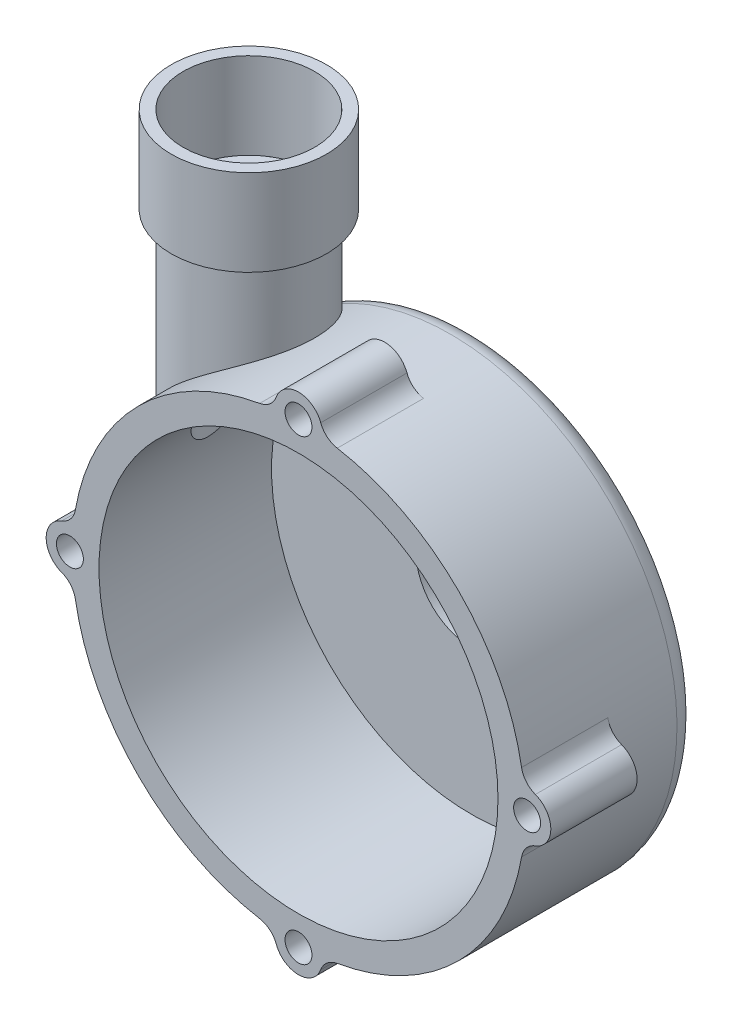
ISO-10303-21;
HEADER;
FILE_DESCRIPTION(('STEP AP214'),'2;1');
FILE_NAME('part.step','',(''),(''),'','','');
FILE_SCHEMA(('AUTOMOTIVE_DESIGN { 1 0 10303 214 1 1 1 1 }'));
ENDSEC;
DATA;
#1=APPLICATION_CONTEXT('core data for automotive mechanical design processes');
#2=APPLICATION_PROTOCOL_DEFINITION('international standard','automotive_design',2000,#1);
#3=PRODUCT_CONTEXT('',#1,'mechanical');
#4=PRODUCT('Part','Part','',(#3));
#5=PRODUCT_RELATED_PRODUCT_CATEGORY('part','',(#4));
#6=PRODUCT_DEFINITION_FORMATION('','',#4);
#7=PRODUCT_DEFINITION_CONTEXT('part definition',#1,'design');
#8=PRODUCT_DEFINITION('design','',#6,#7);
#9=PRODUCT_DEFINITION_SHAPE('','',#8);
#10=(LENGTH_UNIT() NAMED_UNIT(*) SI_UNIT(.MILLI.,.METRE.));
#11=(NAMED_UNIT(*) PLANE_ANGLE_UNIT() SI_UNIT($,.RADIAN.));
#12=(NAMED_UNIT(*) SI_UNIT($,.STERADIAN.) SOLID_ANGLE_UNIT());
#13=UNCERTAINTY_MEASURE_WITH_UNIT(LENGTH_MEASURE(1.E-05),#10,'distance_accuracy_value','');
#14=(GEOMETRIC_REPRESENTATION_CONTEXT(3) GLOBAL_UNCERTAINTY_ASSIGNED_CONTEXT((#13)) GLOBAL_UNIT_ASSIGNED_CONTEXT((#10,
#11,#12)) REPRESENTATION_CONTEXT('',''));
#15=CARTESIAN_POINT('',(0.,0.,0.));
#16=DIRECTION('',(0.,0.,1.));
#17=DIRECTION('',(1.,0.,0.));
#18=AXIS2_PLACEMENT_3D('',#15,#16,#17);
#19=CARTESIAN_POINT('',(-67.,175.,38.));
#20=DIRECTION('',(0.,1.,0.));
#21=DIRECTION('',(0.,0.,1.));
#22=AXIS2_PLACEMENT_3D('',#19,#20,#21);
#23=PLANE('',#22);
#24=CARTESIAN_POINT('',(-67.,175.,38.));
#25=DIRECTION('',(0.,1.,0.));
#26=DIRECTION('',(0.,0.,1.));
#27=AXIS2_PLACEMENT_3D('',#24,#25,#26);
#28=CIRCLE('',#27,36.);
#29=CARTESIAN_POINT('',(-67.,175.,74.));
#30=VERTEX_POINT('',#29);
#31=EDGE_CURVE('E11',#30,#30,#28,.T.);
#32=ORIENTED_EDGE('',*,*,#31,.T.);
#33=EDGE_LOOP('',(#32));
#34=FACE_BOUND('',#33,.T.);
#35=CARTESIAN_POINT('',(-67.,175.,38.));
#36=DIRECTION('',(0.,1.,0.));
#37=DIRECTION('',(0.,0.,1.));
#38=AXIS2_PLACEMENT_3D('',#35,#36,#37);
#39=CIRCLE('',#38,30.5);
#40=CARTESIAN_POINT('',(-67.,175.,68.5));
#41=VERTEX_POINT('',#40);
#42=EDGE_CURVE('E52',#41,#41,#39,.T.);
#43=ORIENTED_EDGE('',*,*,#42,.F.);
#44=EDGE_LOOP('',(#43));
#45=FACE_BOUND('',#44,.T.);
#46=ADVANCED_FACE('F41',(#34,#45),#23,.T.);
#47=CARTESIAN_POINT('',(-67.,135.,38.));
#48=DIRECTION('',(0.,1.,0.));
#49=DIRECTION('',(0.,0.,1.));
#50=AXIS2_PLACEMENT_3D('',#47,#48,#49);
#51=PLANE('',#50);
#52=CARTESIAN_POINT('',(-67.,135.,38.));
#53=DIRECTION('',(0.,1.,0.));
#54=DIRECTION('',(0.,0.,1.));
#55=AXIS2_PLACEMENT_3D('',#52,#53,#54);
#56=CIRCLE('',#55,36.);
#57=CARTESIAN_POINT('',(-67.,135.,74.));
#58=VERTEX_POINT('',#57);
#59=EDGE_CURVE('E45',#58,#58,#56,.T.);
#60=ORIENTED_EDGE('',*,*,#59,.F.);
#61=EDGE_LOOP('',(#60));
#62=FACE_BOUND('',#61,.T.);
#63=CARTESIAN_POINT('',(-67.,135.,38.));
#64=DIRECTION('',(0.,1.,0.));
#65=DIRECTION('',(0.,0.,1.));
#66=AXIS2_PLACEMENT_3D('',#63,#64,#65);
#67=CIRCLE('',#66,30.5);
#68=CARTESIAN_POINT('',(-67.,135.,68.5));
#69=VERTEX_POINT('',#68);
#70=EDGE_CURVE('E54',#69,#69,#67,.T.);
#71=ORIENTED_EDGE('',*,*,#70,.T.);
#72=EDGE_LOOP('',(#71));
#73=FACE_BOUND('',#72,.T.);
#74=ADVANCED_FACE('F64',(#62,#73),#51,.F.);
#75=CARTESIAN_POINT('',(-67.,175.,38.));
#76=DIRECTION('',(0.,-1.,0.));
#77=DIRECTION('',(0.,0.,-1.));
#78=AXIS2_PLACEMENT_3D('',#75,#76,#77);
#79=CYLINDRICAL_SURFACE('',#78,36.);
#80=ORIENTED_EDGE('',*,*,#31,.F.);
#81=EDGE_LOOP('',(#80));
#82=FACE_BOUND('',#81,.T.);
#83=ORIENTED_EDGE('',*,*,#59,.T.);
#84=EDGE_LOOP('',(#83));
#85=FACE_BOUND('',#84,.T.);
#86=ADVANCED_FACE('F43',(#82,#85),#79,.T.);
#87=CARTESIAN_POINT('',(-67.,175.,38.));
#88=DIRECTION('',(0.,-1.,0.));
#89=DIRECTION('',(0.,0.,-1.));
#90=AXIS2_PLACEMENT_3D('',#87,#88,#89);
#91=CYLINDRICAL_SURFACE('',#90,30.5);
#92=ORIENTED_EDGE('',*,*,#42,.T.);
#93=EDGE_LOOP('',(#92));
#94=FACE_BOUND('',#93,.T.);
#95=ORIENTED_EDGE('',*,*,#70,.F.);
#96=EDGE_LOOP('',(#95));
#97=FACE_BOUND('',#96,.T.);
#98=ADVANCED_FACE('F60',(#94,#97),#91,.F.);
#99=CLOSED_SHELL('',(#46,#74,#86,#98));
#100=MANIFOLD_SOLID_BREP('B2',#99);
#101=CARTESIAN_POINT('',(0.,0.,0.));
#102=DIRECTION('',(0.,0.,1.));
#103=DIRECTION('',(1.,0.,0.));
#104=AXIS2_PLACEMENT_3D('',#101,#102,#103);
#105=PLANE('',#104);
#106=CARTESIAN_POINT('',(0.,0.,0.));
#107=DIRECTION('',(0.,0.,1.));
#108=DIRECTION('',(1.,0.,0.));
#109=AXIS2_PLACEMENT_3D('',#106,#107,#108);
#110=CIRCLE('',#109,40.5);
#111=CARTESIAN_POINT('',(40.5,0.,0.));
#112=VERTEX_POINT('',#111);
#113=EDGE_CURVE('E258',#112,#112,#110,.F.);
#114=ORIENTED_EDGE('',*,*,#113,.F.);
#115=EDGE_LOOP('',(#114));
#116=FACE_BOUND('',#115,.T.);
#117=CARTESIAN_POINT('',(0.,0.,0.));
#118=DIRECTION('',(0.,0.,1.));
#119=DIRECTION('',(1.,0.,0.));
#120=AXIS2_PLACEMENT_3D('',#117,#118,#119);
#121=CIRCLE('',#120,70.5);
#122=CARTESIAN_POINT('',(70.5,0.,0.));
#123=VERTEX_POINT('',#122);
#124=EDGE_CURVE('E359',#123,#123,#121,.T.);
#125=ORIENTED_EDGE('',*,*,#124,.F.);
#126=EDGE_LOOP('',(#125));
#127=FACE_BOUND('',#126,.T.);
#128=ADVANCED_FACE('F103',(#116,#127),#105,.F.);
#129=CARTESIAN_POINT('',(0.,30.5,-8.));
#130=CARTESIAN_POINT('',(0.,33.7499417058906,-2.90765348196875));
#131=CARTESIAN_POINT('',(0.,40.5,0.));
#132=B_SPLINE_CURVE_WITH_KNOTS('',2,(#129,#130,#131),.UNSPECIFIED.,.F.,.F.,(3,3),(0.,
0.485735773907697),.UNSPECIFIED.);
#133=CARTESIAN_POINT('',(0.,0.,0.));
#134=DIRECTION('',(0.,0.,1.));
#135=AXIS1_PLACEMENT('',#133,#134);
#136=SURFACE_OF_REVOLUTION('',#132,#135);
#137=ORIENTED_EDGE('',*,*,#113,.T.);
#138=EDGE_LOOP('',(#137));
#139=FACE_BOUND('',#138,.T.);
#140=CARTESIAN_POINT('',(0.,0.,-8.));
#141=DIRECTION('',(0.,0.,1.));
#142=DIRECTION('',(1.,0.,0.));
#143=AXIS2_PLACEMENT_3D('',#140,#141,#142);
#144=CIRCLE('',#143,30.5);
#145=CARTESIAN_POINT('',(30.5,0.,-8.));
#146=VERTEX_POINT('',#145);
#147=EDGE_CURVE('E256',#146,#146,#144,.T.);
#148=ORIENTED_EDGE('',*,*,#147,.T.);
#149=EDGE_LOOP('',(#148));
#150=FACE_BOUND('',#149,.T.);
#151=ADVANCED_FACE('F346',(#139,#150),#136,.T.);
#152=CARTESIAN_POINT('',(0.,0.,-40.));
#153=DIRECTION('',(0.,0.,1.));
#154=DIRECTION('',(1.,0.,0.));
#155=AXIS2_PLACEMENT_3D('',#152,#153,#154);
#156=CYLINDRICAL_SURFACE('',#155,25.5);
#157=CARTESIAN_POINT('',(0.,0.,-40.));
#158=DIRECTION('',(0.,0.,-1.));
#159=DIRECTION('',(-1.,0.,0.));
#160=AXIS2_PLACEMENT_3D('',#157,#158,#159);
#161=CIRCLE('',#160,25.5);
#162=CARTESIAN_POINT('',(-25.5,0.,-40.));
#163=VERTEX_POINT('',#162);
#164=EDGE_CURVE('E361',#163,#163,#161,.T.);
#165=ORIENTED_EDGE('',*,*,#164,.T.);
#166=EDGE_LOOP('',(#165));
#167=FACE_BOUND('',#166,.T.);
#168=CARTESIAN_POINT('',(0.,0.,2.));
#169=DIRECTION('',(0.,0.,1.));
#170=DIRECTION('',(1.,0.,0.));
#171=AXIS2_PLACEMENT_3D('',#168,#169,#170);
#172=CIRCLE('',#171,25.5);
#173=CARTESIAN_POINT('',(25.5,0.,2.));
#174=VERTEX_POINT('',#173);
#175=EDGE_CURVE('E239',#174,#174,#172,.F.);
#176=ORIENTED_EDGE('',*,*,#175,.F.);
#177=EDGE_LOOP('',(#176));
#178=FACE_BOUND('',#177,.T.);
#179=ADVANCED_FACE('F351',(#167,#178),#156,.F.);
#180=CARTESIAN_POINT('',(0.,0.,-40.));
#181=DIRECTION('',(0.,0.,-1.));
#182=DIRECTION('',(-1.,0.,0.));
#183=AXIS2_PLACEMENT_3D('',#180,#181,#182);
#184=PLANE('',#183);
#185=CARTESIAN_POINT('',(0.,0.,-40.));
#186=DIRECTION('',(0.,0.,-1.));
#187=DIRECTION('',(-1.,0.,0.));
#188=AXIS2_PLACEMENT_3D('',#185,#186,#187);
#189=CIRCLE('',#188,30.5);
#190=CARTESIAN_POINT('',(-30.5,0.,-40.));
#191=VERTEX_POINT('',#190);
#192=EDGE_CURVE('E365',#191,#191,#189,.T.);
#193=ORIENTED_EDGE('',*,*,#192,.T.);
#194=EDGE_LOOP('',(#193));
#195=FACE_BOUND('',#194,.T.);
#196=ORIENTED_EDGE('',*,*,#164,.F.);
#197=EDGE_LOOP('',(#196));
#198=FACE_BOUND('',#197,.T.);
#199=ADVANCED_FACE('F384',(#195,#198),#184,.T.);
#200=CARTESIAN_POINT('',(0.,0.,-40.));
#201=DIRECTION('',(0.,0.,1.));
#202=DIRECTION('',(1.,0.,0.));
#203=AXIS2_PLACEMENT_3D('',#200,#201,#202);
#204=CYLINDRICAL_SURFACE('',#203,30.5);
#205=ORIENTED_EDGE('',*,*,#192,.F.);
#206=EDGE_LOOP('',(#205));
#207=FACE_BOUND('',#206,.T.);
#208=ORIENTED_EDGE('',*,*,#147,.F.);
#209=EDGE_LOOP('',(#208));
#210=FACE_BOUND('',#209,.T.);
#211=ADVANCED_FACE('F388',(#207,#210),#204,.T.);
#212=CARTESIAN_POINT('',(0.,73.8958662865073,1.5));
#213=CARTESIAN_POINT('',(0.,72.2097402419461,0.965676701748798));
#214=CARTESIAN_POINT('',(0.,70.5,0.));
#215=B_SPLINE_CURVE_WITH_KNOTS('',2,(#212,#213,#214),.UNSPECIFIED.,.F.,.F.,(3,3),(0.,
0.128312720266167),.UNSPECIFIED.);
#216=CARTESIAN_POINT('',(0.,0.,0.));
#217=DIRECTION('',(0.,0.,1.));
#218=AXIS1_PLACEMENT('',#216,#217);
#219=SURFACE_OF_REVOLUTION('',#215,#218);
#220=ORIENTED_EDGE('',*,*,#124,.T.);
#221=EDGE_LOOP('',(#220));
#222=FACE_BOUND('',#221,.T.);
#223=CARTESIAN_POINT('',(0.,0.,1.5));
#224=DIRECTION('',(0.,0.,1.));
#225=DIRECTION('',(1.,0.,0.));
#226=AXIS2_PLACEMENT_3D('',#223,#224,#225);
#227=CIRCLE('',#226,73.8958662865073);
#228=CARTESIAN_POINT('',(73.8958662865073,0.,1.5));
#229=VERTEX_POINT('',#228);
#230=EDGE_CURVE('E362',#229,#229,#227,.T.);
#231=ORIENTED_EDGE('',*,*,#230,.F.);
#232=EDGE_LOOP('',(#231));
#233=FACE_BOUND('',#232,.T.);
#234=ADVANCED_FACE('F381',(#222,#233),#219,.F.);
#235=CARTESIAN_POINT('',(0.,73.8958662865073,1.5));
#236=DIRECTION('',(0.,0.,-1.));
#237=DIRECTION('',(-1.,0.,0.));
#238=AXIS2_PLACEMENT_3D('',#235,#236,#237);
#239=PLANE('',#238);
#240=CARTESIAN_POINT('',(-88.3346433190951,56.7625836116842,16.2036027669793));
#241=CARTESIAN_POINT('',(-90.0778378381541,58.7753960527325,11.2078691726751));
#242=CARTESIAN_POINT('',(-88.170661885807,56.5732393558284,6.35393458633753));
#243=CARTESIAN_POINT('',(-86.2634859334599,54.3710826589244,1.5));
#244=CARTESIAN_POINT('',(-82.5574002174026,50.0917808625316,1.5));
#245=CARTESIAN_POINT('',(-88.2325666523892,56.9214384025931,16.1036879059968));
#246=CARTESIAN_POINT('',(-89.9438161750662,58.8638592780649,11.1109459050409));
#247=CARTESIAN_POINT('',(-88.0130842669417,56.67115947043,6.30539541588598));
#248=CARTESIAN_POINT('',(-86.0828617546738,54.4781396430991,1.5));
#249=CARTESIAN_POINT('',(-82.3661092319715,50.2574645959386,1.5));
#250=CARTESIAN_POINT('',(-88.1287974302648,57.0819813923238,16.0035221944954));
#251=CARTESIAN_POINT('',(-89.8063214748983,58.9567500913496,11.0149888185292));
#252=CARTESIAN_POINT('',(-87.8536269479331,56.7734020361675,6.25742084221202));
#253=CARTESIAN_POINT('',(-85.9014337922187,54.5897223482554,1.5));
#254=CARTESIAN_POINT('',(-82.176838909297,50.4254601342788,1.5));
#255=CARTESIAN_POINT('',(-87.9179614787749,57.4061777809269,15.8029247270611));
#256=CARTESIAN_POINT('',(-89.5256778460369,59.1505173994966,10.8253872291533));
#257=CARTESIAN_POINT('',(-87.5316118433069,56.9858519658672,6.16262023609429));
#258=CARTESIAN_POINT('',(-85.5380427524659,54.820859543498,1.5));
#259=CARTESIAN_POINT('',(-81.8020727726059,50.7655731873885,1.5));
#260=CARTESIAN_POINT('',(-87.8108951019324,57.5698308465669,15.7024930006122));
#261=CARTESIAN_POINT('',(-89.3825346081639,59.2513769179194,10.7317269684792));
#262=CARTESIAN_POINT('',(-87.3690543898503,57.0960584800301,6.11579408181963));
#263=CARTESIAN_POINT('',(-85.3560653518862,54.9403987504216,1.5));
#264=CARTESIAN_POINT('',(-81.6165765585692,50.9376902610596,1.5));
#265=CARTESIAN_POINT('',(-87.5935899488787,57.8999252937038,15.5016325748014));
#266=CARTESIAN_POINT('',(-89.0915030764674,59.4604368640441,10.5467873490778));
#267=CARTESIAN_POINT('',(-87.0415534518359,57.3237152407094,6.02332454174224));
#268=CARTESIAN_POINT('',(-84.992093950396,55.1866527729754,1.5));
#269=CARTESIAN_POINT('',(-81.2491514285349,51.2854853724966,1.5));
#270=CARTESIAN_POINT('',(-87.4833529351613,58.0663651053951,15.4012039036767));
#271=CARTESIAN_POINT('',(-88.9436192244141,59.5686202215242,10.4554917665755));
#272=CARTESIAN_POINT('',(-86.8766113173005,57.4411615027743,5.97768052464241));
#273=CARTESIAN_POINT('',(-84.810084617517,55.3133526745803,1.5));
#274=CARTESIAN_POINT('',(-81.0672206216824,51.4611614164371,1.5));
#275=CARTESIAN_POINT('',(-87.2596786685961,58.4019524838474,15.200461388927));
#276=CARTESIAN_POINT('',(-88.6436303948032,59.7918647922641,10.2752072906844));
#277=CARTESIAN_POINT('',(-86.5446813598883,57.682779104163,5.88753851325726));
#278=CARTESIAN_POINT('',(-84.4462121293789,55.5733439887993,1.5));
#279=CARTESIAN_POINT('',(-80.7065473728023,51.8157617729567,1.5));
#280=CARTESIAN_POINT('',(-87.1462413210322,58.5711001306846,15.1001475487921));
#281=CARTESIAN_POINT('',(-88.4915245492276,59.9069159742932,10.1862040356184));
#282=CARTESIAN_POINT('',(-86.377693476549,57.8069506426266,5.84304055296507));
#283=CARTESIAN_POINT('',(-84.2643328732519,55.7066277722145,1.5));
#284=CARTESIAN_POINT('',(-80.5278050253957,51.9946861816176,1.5));
#285=CARTESIAN_POINT('',(-86.801652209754,59.0816430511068,14.8000410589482));
#286=CARTESIAN_POINT('',(-88.030952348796,60.2606614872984,9.92335840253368));
#287=CARTESIAN_POINT('',(-85.8749179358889,58.1882017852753,5.71143493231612));
#288=CARTESIAN_POINT('',(-83.7207482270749,56.1143296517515,1.5));
#289=CARTESIAN_POINT('',(-79.9967014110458,52.5350228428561,1.5));
#290=CARTESIAN_POINT('',(-86.5657701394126,59.4268278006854,14.6006633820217));
#291=CARTESIAN_POINT('',(-87.7163208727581,60.5093270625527,9.75248083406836));
#292=CARTESIAN_POINT('',(-85.536632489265,58.4544971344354,5.62602287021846));
#293=CARTESIAN_POINT('',(-83.3587241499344,56.3982218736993,1.5));
#294=CARTESIAN_POINT('',(-79.6486999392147,52.9007266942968,1.5));
#295=CARTESIAN_POINT('',(-86.0815327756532,60.1261223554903,14.2041379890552));
#296=CARTESIAN_POINT('',(-87.0754517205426,61.0285642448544,9.41966582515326));
#297=CARTESIAN_POINT('',(-84.8553724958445,59.0078757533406,5.45961662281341));
#298=CARTESIAN_POINT('',(-82.6370654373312,56.9857471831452,1.5));
#299=CARTESIAN_POINT('',(-78.9623582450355,53.6411468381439,1.5));
#300=CARTESIAN_POINT('',(-85.8331755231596,60.4802335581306,14.0069906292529));
#301=CARTESIAN_POINT('',(-86.7491703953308,61.2991083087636,9.25763040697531));
#302=CARTESIAN_POINT('',(-84.5123972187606,59.2949622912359,5.37862313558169));
#303=CARTESIAN_POINT('',(-82.2773038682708,57.2893744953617,1.5));
#304=CARTESIAN_POINT('',(-78.6240195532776,54.0158645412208,1.5));
#305=CARTESIAN_POINT('',(-85.3252761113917,61.1946747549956,13.6168734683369));
#306=CARTESIAN_POINT('',(-86.0886412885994,61.8577435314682,8.94302368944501));
#307=CARTESIAN_POINT('',(-83.8244845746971,59.8854045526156,5.22132206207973));
#308=CARTESIAN_POINT('',(-81.5619878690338,57.9116407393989,1.5));
#309=CARTESIAN_POINT('',(-77.9565896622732,54.7708168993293,1.5));
#310=CARTESIAN_POINT('',(-85.0657815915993,61.5549749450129,13.4238903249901));
#311=CARTESIAN_POINT('',(-85.7543807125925,62.1457514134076,8.79033088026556));
#312=CARTESIAN_POINT('',(-83.4795601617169,60.188692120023,5.14499735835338));
#313=CARTESIAN_POINT('',(-81.206307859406,58.2302263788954,1.5));
#314=CARTESIAN_POINT('',(-77.6274674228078,55.1510241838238,1.5));
#315=CARTESIAN_POINT('',(-84.5346537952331,62.282376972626,13.0421685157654));
#316=CARTESIAN_POINT('',(-85.0779043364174,62.7378206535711,8.49346489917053));
#317=CARTESIAN_POINT('',(-82.7869308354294,60.8099728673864,4.99656527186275));
#318=CARTESIAN_POINT('',(-80.4975179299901,58.8807249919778,1.5));
#319=CARTESIAN_POINT('',(-76.9755027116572,55.9167360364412,1.5));
#320=CARTESIAN_POINT('',(-84.2630211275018,62.6494784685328,12.8534296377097));
#321=CARTESIAN_POINT('',(-84.7356282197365,63.0418934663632,8.34921064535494));
#322=CARTESIAN_POINT('',(-82.4392260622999,61.1279653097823,4.92445767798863));
#323=CARTESIAN_POINT('',(-80.1442952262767,59.21267014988,1.5));
#324=CARTESIAN_POINT('',(-76.6526599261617,56.3022403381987,1.5));
#325=CARTESIAN_POINT('',(-83.7074760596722,63.3898490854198,12.4809478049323));
#326=CARTESIAN_POINT('',(-84.0438332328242,63.6640081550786,8.06896197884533));
#327=CARTESIAN_POINT('',(-81.7410816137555,61.7765286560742,4.78433373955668));
#328=CARTESIAN_POINT('',(-79.4397972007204,59.8876863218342,1.5));
#329=CARTESIAN_POINT('',(-76.0115453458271,57.0773830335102,1.5));
#330=CARTESIAN_POINT('',(-83.4235568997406,63.7631215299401,12.2972076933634));
#331=CARTESIAN_POINT('',(-83.6942444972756,63.9820857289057,7.93289853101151));
#332=CARTESIAN_POINT('',(-81.3906405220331,62.1071064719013,4.71631969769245));
#333=CARTESIAN_POINT('',(-79.0884168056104,60.2308107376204,1.5));
#334=CARTESIAN_POINT('',(-75.6932761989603,57.46702361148,1.5));
#335=CARTESIAN_POINT('',(-82.8435256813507,64.5149260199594,11.935665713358));
#336=CARTESIAN_POINT('',(-82.98851959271,64.6301661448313,7.66898565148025));
#337=CARTESIAN_POINT('',(-80.6871676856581,62.7787379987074,4.58436404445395));
#338=CARTESIAN_POINT('',(-78.3871901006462,60.9259964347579,1.5));
#339=CARTESIAN_POINT('',(-75.0600761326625,58.2490098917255,1.5));
#340=CARTESIAN_POINT('',(-82.5474134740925,64.8934581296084,11.7578639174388));
#341=CARTESIAN_POINT('',(-82.6323157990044,64.9602080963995,7.54106946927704));
#342=CARTESIAN_POINT('',(-80.3341359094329,63.1197918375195,4.52042248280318));
#343=CARTESIAN_POINT('',(-78.0372453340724,61.2781146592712,1.5));
#344=CARTESIAN_POINT('',(-74.7451452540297,58.6413556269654,1.5));
#345=CARTESIAN_POINT('',(-81.6533221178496,66.0200052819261,11.2418746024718));
#346=CARTESIAN_POINT('',(-81.5712045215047,65.9499472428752,7.17530987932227));
#347=CARTESIAN_POINT('',(-79.2856853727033,64.1415961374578,4.33722405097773));
#348=CARTESIAN_POINT('',(-77.005089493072,62.3284554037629,1.5));
#349=CARTESIAN_POINT('',(-73.8164896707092,59.8042766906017,1.5));
#350=CARTESIAN_POINT('',(-81.0379355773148,66.7745550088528,10.9132312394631));
#351=CARTESIAN_POINT('',(-80.855167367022,66.6261802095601,6.9479751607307));
#352=CARTESIAN_POINT('',(-78.586284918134,64.8347453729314,4.22366344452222));
#353=CARTESIAN_POINT('',(-76.3217218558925,63.0390077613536,1.5));
#354=CARTESIAN_POINT('',(-73.205575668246,60.5770870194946,1.5));
#355=CARTESIAN_POINT('',(-79.7591492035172,68.2968974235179,10.2878955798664));
#356=CARTESIAN_POINT('',(-79.3992816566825,68.0074170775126,6.52443191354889));
#357=CARTESIAN_POINT('',(-77.1735949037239,66.2438451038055,4.01189508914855));
#358=CARTESIAN_POINT('',(-74.9521942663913,64.475992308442,1.5));
#359=CARTESIAN_POINT('',(-71.9818057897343,62.1209577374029,1.5));
#360=CARTESIAN_POINT('',(-79.0957578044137,69.064687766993,9.99119769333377));
#361=CARTESIAN_POINT('',(-78.658904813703,68.7128836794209,6.3278326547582));
#362=CARTESIAN_POINT('',(-76.4603077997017,66.9597915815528,3.91368465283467));
#363=CARTESIAN_POINT('',(-74.2654152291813,65.202993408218,1.5));
#364=CARTESIAN_POINT('',(-71.3689502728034,62.8920184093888,1.5));
#365=CARTESIAN_POINT('',(-77.7187640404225,70.6106701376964,9.43586080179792));
#366=CARTESIAN_POINT('',(-77.1514081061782,70.145402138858,5.96612813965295));
#367=CARTESIAN_POINT('',(-75.0143392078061,68.4068181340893,3.7328331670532));
#368=CARTESIAN_POINT('',(-72.8809627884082,66.6645378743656,1.5));
#369=CARTESIAN_POINT('',(-70.1311144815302,64.4260949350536,1.5));
#370=CARTESIAN_POINT('',(-77.0050963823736,71.3888745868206,9.17727268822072));
#371=CARTESIAN_POINT('',(-76.3836836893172,70.8730429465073,5.8007345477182));
#372=CARTESIAN_POINT('',(-74.281633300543,69.1379169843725,3.65021289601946));
#373=CARTESIAN_POINT('',(-72.1826825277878,67.3997368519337,1.5));
#374=CARTESIAN_POINT('',(-69.506119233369,65.1890987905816,1.5));
#375=CARTESIAN_POINT('',(-75.5272852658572,72.9505603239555,8.70602675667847));
#376=CARTESIAN_POINT('',(-74.8198708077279,72.3418791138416,5.50338348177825));
#377=CARTESIAN_POINT('',(-72.7927817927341,70.6064671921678,3.50153781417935));
#378=CARTESIAN_POINT('',(-70.7687679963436,68.8680188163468,1.5));
#379=CARTESIAN_POINT('',(-68.2356455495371,66.6981464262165,1.5));
#380=CARTESIAN_POINT('',(-74.7631382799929,73.7340419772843,8.49337215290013));
#381=CARTESIAN_POINT('',(-74.0231570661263,73.0837149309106,5.37114939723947));
#382=CARTESIAN_POINT('',(-72.0366345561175,71.3439189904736,3.43548416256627));
#383=CARTESIAN_POINT('',(-70.0525347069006,69.6018056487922,1.5));
#384=CARTESIAN_POINT('',(-67.5901656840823,67.4441890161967,1.5));
#385=CARTESIAN_POINT('',(-73.5672262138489,74.9212364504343,8.21248550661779));
#386=CARTESIAN_POINT('',(-72.7921128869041,74.2136037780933,5.19809276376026));
#387=CARTESIAN_POINT('',(-70.8698660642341,72.460248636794,3.34902283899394));
#388=CARTESIAN_POINT('',(-68.9482653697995,70.7062750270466,1.5));
#389=CARTESIAN_POINT('',(-66.5902034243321,68.5551058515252,1.5));
#390=CARTESIAN_POINT('',(-73.1538449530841,75.324989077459,8.12420639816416));
#391=CARTESIAN_POINT('',(-72.3696148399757,74.5985864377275,5.14404730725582));
#392=CARTESIAN_POINT('',(-70.4693800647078,72.8397051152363,3.32200724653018));
#393=CARTESIAN_POINT('',(-68.5696908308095,71.0803129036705,1.5));
#394=CARTESIAN_POINT('',(-66.2462912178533,68.9294907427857,1.5));
#395=CARTESIAN_POINT('',(-72.3139899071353,76.1316363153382,7.96345000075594));
#396=CARTESIAN_POINT('',(-71.5164065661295,75.3694317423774,5.04605453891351));
#397=CARTESIAN_POINT('',(-69.6606056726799,73.5971692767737,3.27301070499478));
#398=CARTESIAN_POINT('',(-67.8053477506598,71.8243982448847,1.5));
#399=CARTESIAN_POINT('',(-65.549792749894,69.6701235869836,1.5));
#400=CARTESIAN_POINT('',(-71.8875161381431,76.5345309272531,7.89097269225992));
#401=CARTESIAN_POINT('',(-71.0855883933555,75.7554007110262,5.00207997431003));
#402=CARTESIAN_POINT('',(-69.2523172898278,73.9751769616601,3.25102974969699));
#403=CARTESIAN_POINT('',(-67.4194822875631,72.194554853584,1.5));
#404=CARTESIAN_POINT('',(-65.197206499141,70.0363715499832,1.5));
#405=CARTESIAN_POINT('',(-71.0220252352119,77.3383497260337,7.7631899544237));
#406=CARTESIAN_POINT('',(-70.2159089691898,76.5271384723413,4.92480720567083));
#407=CARTESIAN_POINT('',(-68.4277378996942,74.7285927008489,3.21239341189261));
#408=CARTESIAN_POINT('',(-66.6400026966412,72.9296485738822,1.5));
#409=CARTESIAN_POINT('',(-64.4825049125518,70.7594194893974,1.5));
#410=CARTESIAN_POINT('',(-70.583008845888,77.739274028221,7.70788350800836));
#411=CARTESIAN_POINT('',(-69.776929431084,76.9130204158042,4.89148578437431));
#412=CARTESIAN_POINT('',(-68.0114473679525,75.104000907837,3.19573771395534));
#413=CARTESIAN_POINT('',(-66.2462831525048,73.2946990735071,1.5));
#414=CARTESIAN_POINT('',(-64.1203901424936,71.1162200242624,1.5));
#415=CARTESIAN_POINT('',(-69.6931705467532,78.5380020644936,7.61584149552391));
#416=CARTESIAN_POINT('',(-68.8912668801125,77.6835989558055,4.83615917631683));
#417=CARTESIAN_POINT('',(-67.1708344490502,75.851184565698,3.16807432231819));
#418=CARTESIAN_POINT('',(-65.4507189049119,74.0184883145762,1.5));
#419=CARTESIAN_POINT('',(-63.3859524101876,71.8191645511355,1.5));
#420=CARTESIAN_POINT('',(-69.242348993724,78.9358058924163,7.57910536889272));
#421=CARTESIAN_POINT('',(-68.4444531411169,78.068415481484,4.81413656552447));
#422=CARTESIAN_POINT('',(-66.7465123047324,76.2229601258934,3.15706645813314));
#423=CARTESIAN_POINT('',(-65.0487577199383,74.3773437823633,1.5));
#424=CARTESIAN_POINT('',(-63.0136297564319,72.1653088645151,1.5));
#425=CARTESIAN_POINT('',(-68.5586074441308,79.5286618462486,7.5389975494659));
#426=CARTESIAN_POINT('',(-67.7694216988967,78.6435582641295,4.79012026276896));
#427=CARTESIAN_POINT('',(-66.1047502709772,76.7766560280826,3.14505973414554));
#428=CARTESIAN_POINT('',(-64.4401256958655,74.9097135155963,1.5));
#429=CARTESIAN_POINT('',(-62.4477000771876,72.675215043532,1.5));
#430=CARTESIAN_POINT('',(-68.3297552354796,79.7253765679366,7.52813225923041));
#431=CARTESIAN_POINT('',(-67.5439263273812,78.8346617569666,4.78361974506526));
#432=CARTESIAN_POINT('',(-65.8902421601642,76.9603154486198,3.14180969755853));
#433=CARTESIAN_POINT('',(-64.2365870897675,75.0859443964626,1.5));
#434=CARTESIAN_POINT('',(-62.2580762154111,72.8434118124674,1.5));
#435=CARTESIAN_POINT('',(-67.8696261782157,80.1174411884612,7.51152983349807));
#436=CARTESIAN_POINT('',(-67.0913525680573,79.2161506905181,4.77369089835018));
#437=CARTESIAN_POINT('',(-65.4594157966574,77.3263222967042,3.13684528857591));
#438=CARTESIAN_POINT('',(-63.8275081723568,75.4364691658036,1.5));
#439=CARTESIAN_POINT('',(-61.876175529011,73.1767554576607,1.5));
#440=CARTESIAN_POINT('',(-67.6383493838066,80.3127911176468,7.50579258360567));
#441=CARTESIAN_POINT('',(-66.8642555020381,79.406552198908,4.77026167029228));
#442=CARTESIAN_POINT('',(-65.2430975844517,77.5086697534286,3.13513088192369));
#443=CARTESIAN_POINT('',(-63.6219510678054,75.6107780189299,1.5));
#444=CARTESIAN_POINT('',(-61.6838987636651,73.3419024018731,1.5));
#445=CARTESIAN_POINT('',(-66.9410826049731,80.896583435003,7.49651337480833));
#446=CARTESIAN_POINT('',(-66.1807355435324,79.9765463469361,4.76471538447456));
#447=CARTESIAN_POINT('',(-64.5915028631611,78.0536265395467,3.13235745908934));
#448=CARTESIAN_POINT('',(-63.0023129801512,76.1306704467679,1.5));
#449=CARTESIAN_POINT('',(-61.1030656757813,73.8326189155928,1.5));
#450=CARTESIAN_POINT('',(-66.4716450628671,81.2827780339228,7.50090328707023));
#451=CARTESIAN_POINT('',(-65.7219211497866,80.3550648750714,4.76733754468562));
#452=CARTESIAN_POINT('',(-64.1535758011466,78.414159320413,3.13366803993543));
#453=CARTESIAN_POINT('',(-62.5851178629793,76.4733445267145,1.5));
#454=CARTESIAN_POINT('',(-60.7104973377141,74.1534724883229,1.5));
#455=CARTESIAN_POINT('',(-65.7620302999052,81.8562639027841,7.52421513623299));
#456=CARTESIAN_POINT('',(-65.0304300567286,80.9195958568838,4.78127686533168));
#457=CARTESIAN_POINT('',(-63.4922180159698,78.9501656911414,3.14063835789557));
#458=CARTESIAN_POINT('',(-61.9539785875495,76.9807579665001,1.5));
#459=CARTESIAN_POINT('',(-60.1138641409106,74.6248068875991,1.5));
#460=CARTESIAN_POINT('',(-65.5245920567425,82.0464505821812,7.53477281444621));
#461=CARTESIAN_POINT('',(-64.7993440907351,81.1072675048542,4.78759211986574));
#462=CARTESIAN_POINT('',(-63.2710299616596,79.1280285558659,3.14379564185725));
#463=CARTESIAN_POINT('',(-61.7426674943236,77.1488282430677,1.5));
#464=CARTESIAN_POINT('',(-59.913697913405,74.7802545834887,1.5));
#465=CARTESIAN_POINT('',(-65.0482775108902,82.4245903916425,7.56157453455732));
#466=CARTESIAN_POINT('',(-64.3363650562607,81.4813777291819,4.8036367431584));
#467=CARTESIAN_POINT('',(-62.8273951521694,79.4820420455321,3.15181791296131));
#468=CARTESIAN_POINT('',(-61.3183766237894,77.4827451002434,1.5));
#469=CARTESIAN_POINT('',(-59.5108212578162,75.0878223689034,1.5));
#470=CARTESIAN_POINT('',(-64.8094012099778,82.6125435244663,7.57781856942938));
#471=CARTESIAN_POINT('',(-64.1044502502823,81.6678334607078,4.81336760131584));
#472=CARTESIAN_POINT('',(-62.6049483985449,79.6581926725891,3.15668289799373));
#473=CARTESIAN_POINT('',(-61.1053767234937,77.6486067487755,1.5));
#474=CARTESIAN_POINT('',(-59.3081108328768,75.2399424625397,1.5));
#475=CARTESIAN_POINT('',(-64.3304627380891,82.9860359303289,7.61609792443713));
#476=CARTESIAN_POINT('',(-63.6400271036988,82.0394417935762,4.8363235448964));
#477=CARTESIAN_POINT('',(-62.1589676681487,80.0087444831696,3.16816087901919));
#478=CARTESIAN_POINT('',(-60.6778384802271,77.9781020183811,1.5));
#479=CARTESIAN_POINT('',(-58.9002314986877,75.5408471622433,1.5));
#480=CARTESIAN_POINT('',(-64.0904005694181,83.1715752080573,7.63813323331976));
#481=CARTESIAN_POINT('',(-63.4074964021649,82.2246117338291,4.84955081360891));
#482=CARTESIAN_POINT('',(-61.9354336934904,80.1831456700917,3.17477387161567));
#483=CARTESIAN_POINT('',(-60.4632792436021,78.1417506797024,1.5));
#484=CARTESIAN_POINT('',(-58.6950625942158,75.6896317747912,1.5));
#485=CARTESIAN_POINT('',(-63.6093949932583,83.5400268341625,7.6880795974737));
#486=CARTESIAN_POINT('',(-62.9421075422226,82.593561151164,4.87957487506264));
#487=CARTESIAN_POINT('',(-61.4874909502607,80.5301615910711,3.18978589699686));
#488=CARTESIAN_POINT('',(-60.0327825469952,78.4668331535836,1.5));
#489=CARTESIAN_POINT('',(-58.2823651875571,75.9838912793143,1.5));
#490=CARTESIAN_POINT('',(-63.3684515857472,83.7229391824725,7.71599065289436));
#491=CARTESIAN_POINT('',(-62.7092264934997,82.7773580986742,4.89637459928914));
#492=CARTESIAN_POINT('',(-61.2630821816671,80.7027763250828,3.19818492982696));
#493=CARTESIAN_POINT('',(-59.8168234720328,78.6282819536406,1.5));
#494=CARTESIAN_POINT('',(-58.0748366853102,76.1293661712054,1.5));
#495=CARTESIAN_POINT('',(-62.8862253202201,84.0857519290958,7.77772539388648));
#496=CARTESIAN_POINT('',(-62.2436363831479,83.1433120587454,4.93359781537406));
#497=CARTESIAN_POINT('',(-60.8138227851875,81.0460419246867,3.21679654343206));
#498=CARTESIAN_POINT('',(-59.3838950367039,78.9488590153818,1.5));
#499=CARTESIAN_POINT('',(-57.657709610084,76.4169375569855,1.5));
#500=CARTESIAN_POINT('',(-62.6449429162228,84.2656547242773,7.81154410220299));
#501=CARTESIAN_POINT('',(-62.0109039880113,83.3254879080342,4.95402197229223));
#502=CARTESIAN_POINT('',(-60.5889726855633,81.2166943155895,3.22700759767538));
#503=CARTESIAN_POINT('',(-59.1669043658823,79.1080040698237,1.5));
#504=CARTESIAN_POINT('',(-57.4481129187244,76.559036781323,1.5));
#505=CARTESIAN_POINT('',(-62.1624204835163,84.6222283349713,7.88510290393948));
#506=CARTESIAN_POINT('',(-61.5459381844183,83.6881326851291,4.99853904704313));
#507=CARTESIAN_POINT('',(-60.1390462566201,81.556075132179,3.24926612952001));
#508=CARTESIAN_POINT('',(-58.7320171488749,79.4241210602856,1.5));
#509=CARTESIAN_POINT('',(-57.0268164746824,76.8400812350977,1.5));
#510=CARTESIAN_POINT('',(-61.9211804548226,84.7988991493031,7.92484299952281));
#511=CARTESIAN_POINT('',(-61.3136815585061,83.8686189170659,5.02263645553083));
#512=CARTESIAN_POINT('',(-59.9139699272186,81.7248035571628,3.26131360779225));
#513=CARTESIAN_POINT('',(-58.5140980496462,79.5811076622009,1.5));
#514=CARTESIAN_POINT('',(-56.8151167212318,76.9790264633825,1.5));
#515=CARTESIAN_POINT('',(-61.4390441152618,85.1488633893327,8.01024896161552));
#516=CARTESIAN_POINT('',(-60.8499588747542,84.2278779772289,5.07455051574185));
#517=CARTESIAN_POINT('',(-59.463842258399,82.0603918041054,3.28727063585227));
#518=CARTESIAN_POINT('',(-58.0775653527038,79.8930251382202,1.5));
#519=CARTESIAN_POINT('',(-56.3897676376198,77.2538978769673,1.5));
#520=CARTESIAN_POINT('',(-61.1981478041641,85.322156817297,8.05591482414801));
#521=CARTESIAN_POINT('',(-60.6184694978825,84.4066680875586,5.10237248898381));
#522=CARTESIAN_POINT('',(-59.2387909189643,82.2272516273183,3.30118018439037));
#523=CARTESIAN_POINT('',(-57.8589287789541,80.047970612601,1.5));
#524=CARTESIAN_POINT('',(-56.1761183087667,77.3898240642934,1.5));
#525=CARTESIAN_POINT('',(-60.7170787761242,85.6651693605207,8.15314391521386));
#526=CARTESIAN_POINT('',(-60.1566519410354,84.7624861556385,5.16177465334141));
#527=CARTESIAN_POINT('',(-58.7890230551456,82.5591388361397,3.33088125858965));
#528=CARTESIAN_POINT('',(-57.421210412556,80.355927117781,1.5));
#529=CARTESIAN_POINT('',(-55.7470315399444,77.6588221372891,1.5));
#530=CARTESIAN_POINT('',(-60.4769060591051,85.8348884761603,8.20470714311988));
#531=CARTESIAN_POINT('',(-59.9263005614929,84.9395312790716,5.19336102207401));
#532=CARTESIAN_POINT('',(-58.5643065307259,82.7241662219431,3.34667278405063));
#533=CARTESIAN_POINT('',(-57.2021053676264,80.5089526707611,1.5));
#534=CARTESIAN_POINT('',(-55.5315941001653,77.7918940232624,1.5));
#535=CARTESIAN_POINT('',(-59.9975973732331,86.1706088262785,8.31369442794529));
#536=CARTESIAN_POINT('',(-59.4670795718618,85.2918681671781,5.2603346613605));
#537=CARTESIAN_POINT('',(-58.1154718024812,83.0524844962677,3.38015960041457));
#538=CARTESIAN_POINT('',(-56.763656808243,80.8132524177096,1.5));
#539=CARTESIAN_POINT('',(-55.0990471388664,78.0554084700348,1.5));
#540=CARTESIAN_POINT('',(-59.7584616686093,86.3366091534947,8.37111989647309));
#541=CARTESIAN_POINT('',(-59.2381874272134,85.46717650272,5.29572990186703));
#542=CARTESIAN_POINT('',(-57.8913537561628,83.215774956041,3.39785534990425));
#543=CARTESIAN_POINT('',(-56.5442898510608,80.9645406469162,1.5));
#544=CARTESIAN_POINT('',(-54.8819372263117,78.1858503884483,1.5));
#545=CARTESIAN_POINT('',(-59.2819337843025,86.6645039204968,8.49166284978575));
#546=CARTESIAN_POINT('',(-58.7825702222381,85.8157994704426,5.37029098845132));
#547=CARTESIAN_POINT('',(-57.4442690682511,83.5405329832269,3.43513588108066));
#548=CARTESIAN_POINT('',(-56.105737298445,81.2654340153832,1.5));
#549=CARTESIAN_POINT('',(-54.44627946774,78.4443082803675,1.5));
#550=CARTESIAN_POINT('',(-59.0445416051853,86.8263983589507,8.55478033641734));
#551=CARTESIAN_POINT('',(-58.5558232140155,85.9891305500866,5.40946468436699));
#552=CARTESIAN_POINT('',(-57.2213024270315,83.7020005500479,3.45472066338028));
#553=CARTESIAN_POINT('',(-55.8865286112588,81.4150533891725,1.5));
#554=CARTESIAN_POINT('',(-54.2277316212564,78.572324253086,1.5));
#555=CARTESIAN_POINT('',(-58.5718574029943,87.1459624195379,8.6865785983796));
#556=CARTESIAN_POINT('',(-58.1048913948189,86.3338127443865,5.49158454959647));
#557=CARTESIAN_POINT('',(-56.7768647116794,84.0232252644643,3.49578057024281));
#558=CARTESIAN_POINT('',(-55.4485848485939,81.7128208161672,1.5));
#559=CARTESIAN_POINT('',(-53.7893914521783,78.8262030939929,1.5));
#560=CARTESIAN_POINT('',(-58.3365653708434,87.3036320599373,8.75525934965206));
#561=CARTESIAN_POINT('',(-57.8806853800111,86.505180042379,5.53453939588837));
#562=CARTESIAN_POINT('',(-56.5553936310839,84.1829824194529,3.51725568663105));
#563=CARTESIAN_POINT('',(-55.2298268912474,81.860983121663,1.5));
#564=CARTESIAN_POINT('',(-53.5695991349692,78.9520659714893,1.5));
#565=CARTESIAN_POINT('',(-57.8684725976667,87.6146040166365,8.89802235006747));
#566=CARTESIAN_POINT('',(-57.4352793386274,86.8459189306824,5.6242111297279));
#567=CARTESIAN_POINT('',(-56.1143283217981,84.5008857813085,3.56209159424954));
#568=CARTESIAN_POINT('',(-54.7931017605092,82.1560511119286,1.5));
#569=CARTESIAN_POINT('',(-53.1289635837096,79.201936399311,1.5));
#570=CARTESIAN_POINT('',(-57.6356718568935,87.7679063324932,8.97210459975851));
#571=CARTESIAN_POINT('',(-57.2140591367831,87.0153063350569,5.67093753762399));
#572=CARTESIAN_POINT('',(-55.8947340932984,84.6590319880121,3.58545238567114));
#573=CARTESIAN_POINT('',(-54.5751121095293,82.3029710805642,1.5));
#574=CARTESIAN_POINT('',(-52.9081203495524,79.3259439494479,1.5));
#575=CARTESIAN_POINT('',(-56.9408848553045,88.2215461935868,9.20239004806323));
#576=CARTESIAN_POINT('',(-56.5544476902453,87.5213419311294,5.81696684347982));
#577=CARTESIAN_POINT('',(-55.2385835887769,85.1317674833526,3.6584169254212));
#578=CARTESIAN_POINT('',(-53.9215281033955,82.743052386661,1.5));
#579=CARTESIAN_POINT('',(-52.243348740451,79.6962147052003,1.5));
#580=CARTESIAN_POINT('',(-56.483551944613,88.5149160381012,9.36634176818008));
#581=CARTESIAN_POINT('',(-56.1218855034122,87.8545092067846,5.92180282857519));
#582=CARTESIAN_POINT('',(-54.8056353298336,85.4439517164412,3.71081285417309));
#583=CARTESIAN_POINT('',(-53.4880409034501,83.0343707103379,1.5));
#584=CARTESIAN_POINT('',(-51.7981384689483,79.9401737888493,1.5));
#585=CARTESIAN_POINT('',(-55.808891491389,88.9406438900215,9.62629393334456));
#586=CARTESIAN_POINT('',(-55.487277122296,88.3474575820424,6.0897472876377));
#587=CARTESIAN_POINT('',(-54.1658393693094,85.9082487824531,3.79485159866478));
#588=CARTESIAN_POINT('',(-52.8440638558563,83.469284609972,1.5));
#589=CARTESIAN_POINT('',(-51.1290390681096,80.3037388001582,1.5));
#590=CARTESIAN_POINT('',(-55.5858925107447,89.0801665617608,9.71528296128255));
#591=CARTESIAN_POINT('',(-55.2778379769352,88.5108572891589,6.1475947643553));
#592=CARTESIAN_POINT('',(-53.9541765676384,86.0623526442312,3.82377227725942));
#593=CARTESIAN_POINT('',(-52.6301611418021,83.6141068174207,1.5));
#594=CARTESIAN_POINT('',(-50.9057898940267,80.4245326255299,1.5));
#595=CARTESIAN_POINT('',(-55.1442333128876,89.3542438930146,9.89754792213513));
#596=CARTESIAN_POINT('',(-54.8642049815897,88.8353635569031,6.2667777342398));
#597=CARTESIAN_POINT('',(-53.5346336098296,86.3692469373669,3.88336366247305));
#598=CARTESIAN_POINT('',(-52.2047078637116,83.903389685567,1.5));
#599=CARTESIAN_POINT('',(-50.4590850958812,80.6657386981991,1.5));
#600=CARTESIAN_POINT('',(-54.9255730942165,89.488798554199,9.99082385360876));
#601=CARTESIAN_POINT('',(-54.6599985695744,88.9964830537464,6.32812530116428));
#602=CARTESIAN_POINT('',(-53.3267534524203,86.522037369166,3.91403436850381));
#603=CARTESIAN_POINT('',(-51.9931392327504,84.0478647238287,1.5));
#604=CARTESIAN_POINT('',(-50.235629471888,80.786150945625,1.5));
#605=CARTESIAN_POINT('',(-54.4929590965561,89.7528872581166,10.1813081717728));
#606=CARTESIAN_POINT('',(-54.2573714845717,89.3163733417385,6.45419975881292));
#607=CARTESIAN_POINT('',(-52.9152716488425,86.8263947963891,3.9770715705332));
#608=CARTESIAN_POINT('',(-51.5728021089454,84.3366896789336,1.5));
#609=CARTESIAN_POINT('',(-49.7887934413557,81.0269986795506,1.5));
#610=CARTESIAN_POINT('',(-54.2790043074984,89.8824223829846,10.2785157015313));
#611=CARTESIAN_POINT('',(-54.058939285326,89.4751568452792,6.51893846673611));
#612=CARTESIAN_POINT('',(-52.7116690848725,86.97796204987,4.00943769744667));
#613=CARTESIAN_POINT('',(-51.364016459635,84.4810542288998,1.5));
#614=CARTESIAN_POINT('',(-49.5654130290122,81.1474341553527,1.5));
#615=CARTESIAN_POINT('',(-53.8560165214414,90.1365079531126,10.4765518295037));
#616=CARTESIAN_POINT('',(-53.6682899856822,89.790392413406,6.65171746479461));
#617=CARTESIAN_POINT('',(-52.3091402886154,87.2800325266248,4.07582714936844));
#618=CARTESIAN_POINT('',(-50.9496076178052,84.7699600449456,1.5));
#619=CARTESIAN_POINT('',(-49.118917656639,81.3887980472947,1.5));
#620=CARTESIAN_POINT('',(-53.6469835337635,90.2610583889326,10.5773804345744));
#621=CARTESIAN_POINT('',(-53.4760651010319,89.9468558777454,6.71977072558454));
#622=CARTESIAN_POINT('',(-52.1102140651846,87.4305357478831,4.10985047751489));
#623=CARTESIAN_POINT('',(-50.7439696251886,84.9145161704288,1.5));
#624=CARTESIAN_POINT('',(-48.8958026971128,81.5097264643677,1.5));
#625=CARTESIAN_POINT('',(-53.2342373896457,90.5051016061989,10.7822333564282));
#626=CARTESIAN_POINT('',(-53.0984496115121,90.2572928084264,6.85902552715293));
#627=CARTESIAN_POINT('',(-51.717592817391,87.7304987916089,4.17947781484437));
#628=CARTESIAN_POINT('',(-50.3363418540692,85.2040059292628,1.5));
#629=CARTESIAN_POINT('',(-48.4500962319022,81.7525263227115,1.5));
#630=CARTESIAN_POINT('',(-53.0305240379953,90.6245945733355,10.8862575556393));
#631=CARTESIAN_POINT('',(-52.9130540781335,90.4112764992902,6.93024007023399));
#632=CARTESIAN_POINT('',(-51.523897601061,87.879958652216,4.21508176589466));
#633=CARTESIAN_POINT('',(-50.1343393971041,85.3489544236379,1.5));
#634=CARTESIAN_POINT('',(-48.2275047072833,81.8743977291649,1.5));
#635=CARTESIAN_POINT('',(-52.6287208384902,90.8585213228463,11.0970731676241));
#636=CARTESIAN_POINT('',(-52.5496613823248,90.7166252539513,7.07565907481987));
#637=CARTESIAN_POINT('',(-51.142263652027,88.177880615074,4.2877911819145));
#638=CARTESIAN_POINT('',(-49.734463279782,85.6394502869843,1.5));
#639=CARTESIAN_POINT('',(-47.7831104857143,82.1195692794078,1.5));
#640=CARTESIAN_POINT('',(-52.4306309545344,90.9729551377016,11.2038645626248));
#641=CARTESIAN_POINT('',(-52.3716627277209,90.8679991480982,7.1498766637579));
#642=CARTESIAN_POINT('',(-50.9543248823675,88.3263427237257,4.32489663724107));
#643=CARTESIAN_POINT('',(-49.5365795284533,85.7850125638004,1.5));
#644=CARTESIAN_POINT('',(-47.5613077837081,82.2428694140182,1.5));
#645=CARTESIAN_POINT('',(-52.0551876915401,91.1882658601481,11.4115675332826));
#646=CARTESIAN_POINT('',(-52.0368826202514,91.1565189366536,7.29537024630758));
#647=CARTESIAN_POINT('',(-50.5988148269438,88.6110007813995,4.39764949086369));
#648=CARTESIAN_POINT('',(-49.1603988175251,86.0657614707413,1.5));
#649=CARTESIAN_POINT('',(-47.1356915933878,82.4818711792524,1.5));
#650=CARTESIAN_POINT('',(-51.8774070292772,91.28951026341,11.5123041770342));
#651=CARTESIAN_POINT('',(-51.8794947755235,91.2938963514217,7.36645929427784));
#652=CARTESIAN_POINT('',(-50.4307851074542,88.747266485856,4.43319137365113));
#653=CARTESIAN_POINT('',(-48.9817256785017,86.200924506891,1.5));
#654=CARTESIAN_POINT('',(-46.9317996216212,82.597432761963,1.5));
#655=CARTESIAN_POINT('',(-51.526931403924,91.4877901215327,11.7154963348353));
#656=CARTESIAN_POINT('',(-51.5718295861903,91.5662105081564,7.51096331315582));
#657=CARTESIAN_POINT('',(-50.1004387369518,89.0190121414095,4.5054432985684));
#658=CARTESIAN_POINT('',(-48.6286969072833,86.4721023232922,1.5));
#659=CARTESIAN_POINT('',(-46.525166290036,82.8305769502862,1.5));
#660=CARTESIAN_POINT('',(-51.3542366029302,91.5848254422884,11.8179519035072));
#661=CARTESIAN_POINT('',(-51.4215560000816,91.7011522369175,7.58438874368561));
#662=CARTESIAN_POINT('',(-49.9381222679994,89.1544920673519,4.54215337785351));
#663=CARTESIAN_POINT('',(-48.4543372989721,86.6081291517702,1.5));
#664=CARTESIAN_POINT('',(-46.3224249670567,82.9481596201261,1.5));
#665=CARTESIAN_POINT('',(-50.844404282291,91.8694617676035,12.1271451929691));
#666=CARTESIAN_POINT('',(-50.9818878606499,92.1021789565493,7.80802182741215));
#667=CARTESIAN_POINT('',(-49.4607057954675,89.5594131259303,4.65384686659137));
#668=CARTESIAN_POINT('',(-47.938122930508,87.0178366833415,1.5));
#669=CARTESIAN_POINT('',(-45.7166416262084,83.304324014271,1.5));
#670=CARTESIAN_POINT('',(-50.5152211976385,92.0507633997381,12.3358750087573));
#671=CARTESIAN_POINT('',(-50.7043844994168,92.3638345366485,7.96127111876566));
#672=CARTESIAN_POINT('',(-49.1548560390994,89.8275608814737,4.73045133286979));
#673=CARTESIAN_POINT('',(-47.603958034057,87.292536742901,1.5));
#674=CARTESIAN_POINT('',(-45.3157027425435,83.5465098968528,1.5));
#675=CARTESIAN_POINT('',(-49.8793030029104,92.3968905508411,12.7556625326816));
#676=CARTESIAN_POINT('',(-50.1831535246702,92.8742853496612,8.27496511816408));
#677=CARTESIAN_POINT('',(-48.5716294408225,90.3594072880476,4.88729831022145));
#678=CARTESIAN_POINT('',(-46.9587345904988,87.8457786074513,1.5));
#679=CARTESIAN_POINT('',(-44.5224290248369,84.0432660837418,1.5));
#680=CARTESIAN_POINT('',(-49.5725315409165,92.5617429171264,12.9667158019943));
#681=CARTESIAN_POINT('',(-49.9394578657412,93.1231108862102,8.43547445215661));
#682=CARTESIAN_POINT('',(-48.2942061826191,90.6231125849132,4.96753457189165));
#683=CARTESIAN_POINT('',(-46.647658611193,88.1244074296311,1.5));
#684=CARTESIAN_POINT('',(-44.1300810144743,84.2978151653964,1.5));
#685=CARTESIAN_POINT('',(-49.1290151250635,92.797456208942,13.2833885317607));
#686=CARTESIAN_POINT('',(-49.6013618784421,93.4846790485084,8.68062694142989));
#687=CARTESIAN_POINT('',(-47.9014424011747,91.0147090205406,5.09026238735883));
#688=CARTESIAN_POINT('',(-46.2011953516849,88.5450650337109,1.5));
#689=CARTESIAN_POINT('',(-43.5493568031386,84.6917193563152,1.5));
#690=CARTESIAN_POINT('',(-48.9838523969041,92.8741502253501,13.3890368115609));
#691=CARTESIAN_POINT('',(-49.492984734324,93.603557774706,8.76330110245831));
#692=CARTESIAN_POINT('',(-47.7743341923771,91.1446720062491,5.13159749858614));
#693=CARTESIAN_POINT('',(-46.0553708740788,88.686114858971,1.5));
#694=CARTESIAN_POINT('',(-43.3569475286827,84.825133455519,1.5));
#695=CARTESIAN_POINT('',(-48.6991774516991,93.0237344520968,13.5999865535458));
#696=CARTESIAN_POINT('',(-49.2856472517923,93.8370625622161,8.93001410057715));
#697=CARTESIAN_POINT('',(-47.5283997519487,91.4029350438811,5.21495370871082));
#698=CARTESIAN_POINT('',(-45.7708372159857,88.9691381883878,1.5));
#699=CARTESIAN_POINT('',(-42.9752123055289,85.0963485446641,1.5));
#700=CARTESIAN_POINT('',(-48.5596659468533,93.0966241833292,13.70528797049));
#701=CARTESIAN_POINT('',(-49.1867069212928,93.9516831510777,9.01406084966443));
#702=CARTESIAN_POINT('',(-47.40957456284,91.5312348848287,5.25697489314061));
#703=CARTESIAN_POINT('',(-45.6321398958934,89.1111213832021,1.5));
#704=CARTESIAN_POINT('',(-42.7858867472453,85.2341500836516,1.5));
#705=CARTESIAN_POINT('',(-48.423006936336,93.1676520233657,13.8102388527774));
#706=CARTESIAN_POINT('',(-49.0927747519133,94.0637882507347,9.09857989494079));
#707=CARTESIAN_POINT('',(-47.295110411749,91.6585485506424,5.2992899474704));
#708=CARTESIAN_POINT('',(-45.4974460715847,89.2533088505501,1.5));
#709=CARTESIAN_POINT('',(-42.5983194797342,85.3743342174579,1.5));
#710=(BOUNDED_SURFACE() B_SPLINE_SURFACE(3,2,((#240,#241,#242,#243,#244),(#245,#246,#247,#248,
#249),(#250,#251,#252,#253,#254),(#255,#256,#257,#258,#259),(#260,#261,#262,#263,#264),(#265,
#266,#267,#268,#269),(#270,#271,#272,#273,#274),(#275,#276,#277,#278,#279),(#280,#281,#282,#283,
#284),(#285,#286,#287,#288,#289),(#290,#291,#292,#293,#294),(#295,#296,#297,#298,#299),(#300,
#301,#302,#303,#304),(#305,#306,#307,#308,#309),(#310,#311,#312,#313,#314),(#315,#316,#317,#318,
#319),(#320,#321,#322,#323,#324),(#325,#326,#327,#328,#329),(#330,#331,#332,#333,#334),(#335,
#336,#337,#338,#339),(#340,#341,#342,#343,#344),(#345,#346,#347,#348,#349),(#350,#351,#352,#353,
#354),(#355,#356,#357,#358,#359),(#360,#361,#362,#363,#364),(#365,#366,#367,#368,#369),(#370,
#371,#372,#373,#374),(#375,#376,#377,#378,#379),(#380,#381,#382,#383,#384),(#385,#386,#387,#388,
#389),(#390,#391,#392,#393,#394),(#395,#396,#397,#398,#399),(#400,#401,#402,#403,#404),(#405,
#406,#407,#408,#409),(#410,#411,#412,#413,#414),(#415,#416,#417,#418,#419),(#420,#421,#422,#423,
#424),(#425,#426,#427,#428,#429),(#430,#431,#432,#433,#434),(#435,#436,#437,#438,#439),(#440,
#441,#442,#443,#444),(#445,#446,#447,#448,#449),(#450,#451,#452,#453,#454),(#455,#456,#457,#458,
#459),(#460,#461,#462,#463,#464),(#465,#466,#467,#468,#469),(#470,#471,#472,#473,#474),(#475,
#476,#477,#478,#479),(#480,#481,#482,#483,#484),(#485,#486,#487,#488,#489),(#490,#491,#492,#493,
#494),(#495,#496,#497,#498,#499),(#500,#501,#502,#503,#504),(#505,#506,#507,#508,#509),(#510,
#511,#512,#513,#514),(#515,#516,#517,#518,#519),(#520,#521,#522,#523,#524),(#525,#526,#527,#528,
#529),(#530,#531,#532,#533,#534),(#535,#536,#537,#538,#539),(#540,#541,#542,#543,#544),(#545,
#546,#547,#548,#549),(#550,#551,#552,#553,#554),(#555,#556,#557,#558,#559),(#560,#561,#562,#563,
#564),(#565,#566,#567,#568,#569),(#570,#571,#572,#573,#574),(#575,#576,#577,#578,#579),(#580,
#581,#582,#583,#584),(#585,#586,#587,#588,#589),(#590,#591,#592,#593,#594),(#595,#596,#597,#598,
#599),(#600,#601,#602,#603,#604),(#605,#606,#607,#608,#609),(#610,#611,#612,#613,#614),(#615,
#616,#617,#618,#619),(#620,#621,#622,#623,#624),(#625,#626,#627,#628,#629),(#630,#631,#632,#633,
#634),(#635,#636,#637,#638,#639),(#640,#641,#642,#643,#644),(#645,#646,#647,#648,#649),(#650,
#651,#652,#653,#654),(#655,#656,#657,#658,#659),(#660,#661,#662,#663,#664),(#665,#666,#667,#668,
#669),(#670,#671,#672,#673,#674),(#675,#676,#677,#678,#679),(#680,#681,#682,#683,#684),(#685,
#686,#687,#688,#689),(#690,#691,#692,#693,#694),(#695,#696,#697,#698,#699),(#700,#701,#702,#703,
#704),(#705,#706,#707,#708,#709)),.UNSPECIFIED.,.F.,.F.,.F.) B_SPLINE_SURFACE_WITH_KNOTS((4,2,2,
2,2,2,2,2,2,2,2,2,2,2,2,2,2,2,2,2,2,2,2,2,2,2,2,2,2,2,2,2,2,2,2,2,2,2,2,2,2,2,2,2,2,2,4),(3,2,
3),(0.,0.759164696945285,1.51824850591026,2.27691821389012,3.03561039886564,4.54983093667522,
6.06429001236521,7.57281491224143,9.08126423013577,10.5905542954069,12.099862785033,
15.0552025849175,18.0100244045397,20.9687569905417,23.9276965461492,25.4526906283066,
26.9776828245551,28.5025846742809,30.0274404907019,30.787823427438,31.548189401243,
33.0688840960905,33.8291696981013,34.5894543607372,35.3497375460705,36.110020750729,
36.8696664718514,37.6293124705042,38.388957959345,39.1486033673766,39.9084321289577,
40.6682611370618,41.428086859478,42.1879126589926,43.7108864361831,44.4723872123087,
45.2338877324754,45.9952231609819,46.7565600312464,47.5178689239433,48.279172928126,
48.9822540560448,49.6853575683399,51.0904062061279,52.4931227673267,53.1954816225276,
53.8979287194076),(0.,0.5,1.),
.UNSPECIFIED.) GEOMETRIC_REPRESENTATION_ITEM() RATIONAL_B_SPLINE_SURFACE(((1.,0.870231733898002,
1.,0.870231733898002,1.),(1.,0.871626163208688,1.,0.871626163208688,1.),(1.,0.873001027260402,
1.,0.873001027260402,1.),(1.,0.875711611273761,1.,0.875711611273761,1.),(1.,0.877047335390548,
1.,0.877047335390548,1.),(1.,0.879679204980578,1.,0.879679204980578,1.),(1.,0.880975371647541,
1.,0.880975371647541,1.),(1.,0.883529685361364,1.,0.883529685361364,1.),(1.,0.884787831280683,
1.,0.884787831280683,1.),(1.,0.888501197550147,1.,0.888501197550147,1.),(1.,0.890900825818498,
1.,0.890900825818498,1.),(1.,0.895558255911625,1.,0.895558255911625,1.),(1.,0.897816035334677,
1.,0.897816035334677,1.),(1.,0.902185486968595,1.,0.902185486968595,1.),(1.,0.904297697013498,
1.,0.904297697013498,1.),(1.,0.908391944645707,1.,0.908391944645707,1.),(1.,0.910373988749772,
1.,0.910373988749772,1.),(1.,0.914213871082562,1.,0.914213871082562,1.),(1.,0.916071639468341,
1.,0.916071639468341,1.),(1.,0.919665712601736,1.,0.919665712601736,1.),(1.,0.921402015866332,
1.,0.921402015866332,1.),(1.,0.926363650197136,1.,0.926363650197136,1.),(1.,0.929421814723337,
1.,0.929421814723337,1.),(1.,0.935100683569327,1.,0.935100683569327,1.),(1.,0.937721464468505,
1.,0.937721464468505,1.),(1.,0.942530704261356,1.,0.942530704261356,1.),(1.,0.944718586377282,
1.,0.944718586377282,1.),(1.,0.948644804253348,1.,0.948644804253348,1.),(1.,0.950383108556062,
1.,0.950383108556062,1.),(1.,0.952653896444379,1.,0.952653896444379,1.),(1.,0.953362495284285,
1.,0.953362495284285,1.),(1.,0.95464646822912,1.,0.95464646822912,1.),(1.,0.955221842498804,1.,
0.955221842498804,1.),(1.,0.956232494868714,1.,0.956232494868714,1.),(1.,0.956667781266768,1.,
0.956667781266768,1.),(1.,0.957390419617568,1.,0.957390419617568,1.),(1.,0.95767777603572,1.,
0.95767777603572,1.),(1.,0.957991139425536,1.,0.957991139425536,1.),(1.,0.958075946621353,1.,
0.958075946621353,1.),(1.,0.958205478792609,1.,0.958205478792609,1.),(1.,0.958250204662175,1.,
0.958250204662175,1.),(1.,0.958322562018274,1.,0.958322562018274,1.),(1.,0.958288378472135,1.,
0.958288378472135,1.),(1.,0.958106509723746,1.,0.958106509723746,1.),(1.,0.958024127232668,1.,
0.958024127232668,1.),(1.,0.957814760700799,1.,0.957814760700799,1.),(1.,0.957687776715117,1.,
0.957687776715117,1.),(1.,0.957388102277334,1.,0.957388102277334,1.),(1.,0.957215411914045,1.,
0.957215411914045,1.),(1.,0.956823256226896,1.,0.956823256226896,1.),(1.,0.956603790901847,1.,
0.956603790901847,1.),(1.,0.956117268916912,1.,0.956117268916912,1.),(1.,0.955850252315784,1.,
0.955850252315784,1.),(1.,0.955267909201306,1.,0.955267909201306,1.),(1.,0.954952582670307,1.,
0.954952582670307,1.),(1.,0.954272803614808,1.,0.954272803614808,1.),(1.,0.953908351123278,1.,
0.953908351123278,1.),(1.,0.953129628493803,1.,0.953129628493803,1.),(1.,0.952715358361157,1.,
0.952715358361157,1.),(1.,0.951836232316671,1.,0.951836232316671,1.),(1.,0.951371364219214,1.,
0.951371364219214,1.),(1.,0.950391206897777,1.,0.950391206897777,1.),(1.,0.949875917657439,1.,
0.949875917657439,1.),(1.,0.948794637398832,1.,0.948794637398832,1.),(1.,0.94822864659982,1.,
0.94822864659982,1.),(1.,0.947045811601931,1.,0.947045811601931,1.),(1.,0.946428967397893,1.,
0.946428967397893,1.),(1.,0.944500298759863,1.,0.944500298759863,1.),(1.,0.943112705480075,1.,
0.943112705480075,1.),(1.,0.940881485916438,1.,0.940881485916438,1.),(1.,0.940112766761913,1.,
0.940112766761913,1.),(1.,0.938526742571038,1.,0.938526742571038,1.),(1.,0.93770943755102,1.,
0.93770943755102,1.),(1.,0.936027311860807,1.,0.936027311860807,1.),(1.,0.935162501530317,1.,
0.935162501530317,1.),(1.,0.933386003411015,1.,0.933386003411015,1.),(1.,0.932474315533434,1.,
0.932474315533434,1.),(1.,0.93060570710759,1.,0.93060570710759,1.),(1.,0.929648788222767,1.,
0.929648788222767,1.),(1.,0.927691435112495,1.,0.927691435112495,1.),(1.,0.926691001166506,1.,
0.926691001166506,1.),(1.,0.924726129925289,1.,0.924726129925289,1.),(1.,0.923764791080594,1.,
0.923764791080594,1.),(1.,0.921807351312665,1.,0.921807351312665,1.),(1.,0.920811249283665,1.,
0.920811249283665,1.),(1.,0.917775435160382,1.,0.917775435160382,1.),(1.,0.915686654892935,1.,
0.915686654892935,1.),(1.,0.911394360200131,1.,0.911394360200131,1.),(1.,0.909191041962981,1.,
0.909191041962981,1.),(1.,0.905808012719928,1.,0.905808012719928,1.),(1.,0.904666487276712,1.,
0.904666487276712,1.),(1.,0.902360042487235,1.,0.902360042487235,1.),(1.,0.901195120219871,1.,
0.901195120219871,1.),(1.,0.900019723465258,1.,0.900019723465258,1.))) REPRESENTATION_ITEM('') SURFACE());
#711=CARTESIAN_POINT('',(-82.5574002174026,50.0917808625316,1.5));
#712=CARTESIAN_POINT('',(-82.3661092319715,50.2574645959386,1.5));
#713=CARTESIAN_POINT('',(-82.176838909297,50.4254601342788,1.5));
#714=CARTESIAN_POINT('',(-81.8020727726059,50.7655731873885,1.5));
#715=CARTESIAN_POINT('',(-81.6165765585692,50.9376902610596,1.5));
#716=CARTESIAN_POINT('',(-81.2491514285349,51.2854853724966,1.5));
#717=CARTESIAN_POINT('',(-81.0672206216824,51.4611614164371,1.5));
#718=CARTESIAN_POINT('',(-80.7065473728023,51.8157617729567,1.5));
#719=CARTESIAN_POINT('',(-80.5278050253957,51.9946861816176,1.5));
#720=CARTESIAN_POINT('',(-79.9967014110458,52.5350228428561,1.5));
#721=CARTESIAN_POINT('',(-79.6486999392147,52.9007266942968,1.5));
#722=CARTESIAN_POINT('',(-78.9623582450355,53.6411468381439,1.5));
#723=CARTESIAN_POINT('',(-78.6240195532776,54.0158645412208,1.5));
#724=CARTESIAN_POINT('',(-77.9565896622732,54.7708168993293,1.5));
#725=CARTESIAN_POINT('',(-77.6274674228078,55.1510241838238,1.5));
#726=CARTESIAN_POINT('',(-76.9755027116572,55.9167360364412,1.5));
#727=CARTESIAN_POINT('',(-76.6526599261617,56.3022403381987,1.5));
#728=CARTESIAN_POINT('',(-76.0115453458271,57.0773830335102,1.5));
#729=CARTESIAN_POINT('',(-75.6932761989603,57.46702361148,1.5));
#730=CARTESIAN_POINT('',(-75.0600761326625,58.2490098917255,1.5));
#731=CARTESIAN_POINT('',(-74.7451452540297,58.6413556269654,1.5));
#732=CARTESIAN_POINT('',(-73.8164896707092,59.8042766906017,1.5));
#733=CARTESIAN_POINT('',(-73.205575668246,60.5770870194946,1.5));
#734=CARTESIAN_POINT('',(-71.9818057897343,62.1209577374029,1.5));
#735=CARTESIAN_POINT('',(-71.3689502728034,62.8920184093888,1.5));
#736=CARTESIAN_POINT('',(-70.1311144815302,64.4260949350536,1.5));
#737=CARTESIAN_POINT('',(-69.506119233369,65.1890987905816,1.5));
#738=CARTESIAN_POINT('',(-68.2356455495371,66.6981464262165,1.5));
#739=CARTESIAN_POINT('',(-67.5901656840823,67.4441890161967,1.5));
#740=CARTESIAN_POINT('',(-66.5902034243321,68.5551058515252,1.5));
#741=CARTESIAN_POINT('',(-66.2462912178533,68.9294907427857,1.5));
#742=CARTESIAN_POINT('',(-65.549792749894,69.6701235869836,1.5));
#743=CARTESIAN_POINT('',(-65.197206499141,70.0363715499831,1.5));
#744=CARTESIAN_POINT('',(-64.4825049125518,70.7594194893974,1.5));
#745=CARTESIAN_POINT('',(-64.1203901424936,71.1162200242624,1.5));
#746=CARTESIAN_POINT('',(-63.3859524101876,71.8191645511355,1.5));
#747=CARTESIAN_POINT('',(-63.0136297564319,72.1653088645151,1.5));
#748=CARTESIAN_POINT('',(-62.4477000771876,72.675215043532,1.5));
#749=CARTESIAN_POINT('',(-62.2580762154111,72.8434118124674,1.5));
#750=CARTESIAN_POINT('',(-61.8761755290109,73.1767554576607,1.5));
#751=CARTESIAN_POINT('',(-61.6838987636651,73.3419024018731,1.5));
#752=CARTESIAN_POINT('',(-61.1030656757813,73.8326189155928,1.5));
#753=CARTESIAN_POINT('',(-60.7104973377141,74.1534724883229,1.5));
#754=CARTESIAN_POINT('',(-60.1138641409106,74.6248068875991,1.5));
#755=CARTESIAN_POINT('',(-59.913697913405,74.7802545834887,1.5));
#756=CARTESIAN_POINT('',(-59.5108212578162,75.0878223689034,1.5));
#757=CARTESIAN_POINT('',(-59.3081108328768,75.2399424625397,1.5));
#758=CARTESIAN_POINT('',(-58.9002314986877,75.5408471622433,1.5));
#759=CARTESIAN_POINT('',(-58.6950625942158,75.6896317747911,1.5));
#760=CARTESIAN_POINT('',(-58.2823651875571,75.9838912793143,1.5));
#761=CARTESIAN_POINT('',(-58.0748366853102,76.1293661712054,1.5));
#762=CARTESIAN_POINT('',(-57.657709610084,76.4169375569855,1.5));
#763=CARTESIAN_POINT('',(-57.4481129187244,76.559036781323,1.5));
#764=CARTESIAN_POINT('',(-57.0268164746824,76.8400812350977,1.5));
#765=CARTESIAN_POINT('',(-56.8151167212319,76.9790264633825,1.5));
#766=CARTESIAN_POINT('',(-56.3897676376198,77.2538978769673,1.5));
#767=CARTESIAN_POINT('',(-56.1761183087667,77.3898240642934,1.5));
#768=CARTESIAN_POINT('',(-55.7470315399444,77.6588221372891,1.5));
#769=CARTESIAN_POINT('',(-55.5315941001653,77.7918940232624,1.5));
#770=CARTESIAN_POINT('',(-55.0990471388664,78.0554084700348,1.5));
#771=CARTESIAN_POINT('',(-54.8819372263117,78.1858503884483,1.5));
#772=CARTESIAN_POINT('',(-54.44627946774,78.4443082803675,1.5));
#773=CARTESIAN_POINT('',(-54.2277316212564,78.572324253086,1.5));
#774=CARTESIAN_POINT('',(-53.7893914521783,78.8262030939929,1.5));
#775=CARTESIAN_POINT('',(-53.5695991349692,78.9520659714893,1.5));
#776=CARTESIAN_POINT('',(-53.1289635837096,79.201936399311,1.5));
#777=CARTESIAN_POINT('',(-52.9081203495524,79.3259439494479,1.5));
#778=CARTESIAN_POINT('',(-52.243348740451,79.6962147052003,1.5));
#779=CARTESIAN_POINT('',(-51.7981384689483,79.9401737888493,1.5));
#780=CARTESIAN_POINT('',(-51.1290390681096,80.3037388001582,1.5));
#781=CARTESIAN_POINT('',(-50.9057898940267,80.4245326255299,1.5));
#782=CARTESIAN_POINT('',(-50.4590850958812,80.6657386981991,1.5));
#783=CARTESIAN_POINT('',(-50.235629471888,80.786150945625,1.5));
#784=CARTESIAN_POINT('',(-49.7887934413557,81.0269986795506,1.5));
#785=CARTESIAN_POINT('',(-49.5654130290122,81.1474341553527,1.5));
#786=CARTESIAN_POINT('',(-49.118917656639,81.3887980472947,1.5));
#787=CARTESIAN_POINT('',(-48.8958026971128,81.5097264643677,1.5));
#788=CARTESIAN_POINT('',(-48.4500962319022,81.7525263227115,1.5));
#789=CARTESIAN_POINT('',(-48.2275047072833,81.8743977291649,1.5));
#790=CARTESIAN_POINT('',(-47.7831104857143,82.1195692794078,1.5));
#791=CARTESIAN_POINT('',(-47.5613077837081,82.2428694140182,1.5));
#792=CARTESIAN_POINT('',(-47.1356915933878,82.4818711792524,1.5));
#793=CARTESIAN_POINT('',(-46.9317996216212,82.597432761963,1.5));
#794=CARTESIAN_POINT('',(-46.525166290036,82.8305769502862,1.5));
#795=CARTESIAN_POINT('',(-46.3224249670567,82.9481596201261,1.5));
#796=CARTESIAN_POINT('',(-45.7166416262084,83.304324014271,1.5));
#797=CARTESIAN_POINT('',(-45.3157027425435,83.5465098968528,1.5));
#798=CARTESIAN_POINT('',(-44.5224290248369,84.0432660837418,1.5));
#799=CARTESIAN_POINT('',(-44.1300810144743,84.2978151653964,1.5));
#800=CARTESIAN_POINT('',(-43.5493568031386,84.6917193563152,1.5));
#801=CARTESIAN_POINT('',(-43.3569475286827,84.825133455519,1.5));
#802=CARTESIAN_POINT('',(-42.9752123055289,85.0963485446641,1.5));
#803=CARTESIAN_POINT('',(-42.7858867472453,85.2341500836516,1.5));
#804=CARTESIAN_POINT('',(-42.5983194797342,85.3743342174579,1.5));
#805=B_SPLINE_CURVE_WITH_KNOTS('',3,(#711,#712,#713,#714,#715,#716,#717,#718,#719,#720,#721,
#722,#723,#724,#725,#726,#727,#728,#729,#730,#731,#732,#733,#734,#735,#736,#737,#738,#739,#740,
#741,#742,#743,#744,#745,#746,#747,#748,#749,#750,#751,#752,#753,#754,#755,#756,#757,#758,#759,
#760,#761,#762,#763,#764,#765,#766,#767,#768,#769,#770,#771,#772,#773,#774,#775,#776,#777,#778,
#779,#780,#781,#782,#783,#784,#785,#786,#787,#788,#789,#790,#791,#792,#793,#794,#795,#796,#797,
#798,#799,#800,#801,#802,#803,#804),.UNSPECIFIED.,.F.,.F.,(4,2,2,2,2,2,2,2,2,2,2,2,2,2,2,2,2,2,
2,2,2,2,2,2,2,2,2,2,2,2,2,2,2,2,2,2,2,2,2,2,2,2,2,2,2,2,4),(0.,0.759164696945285,
1.51824850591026,2.27691821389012,3.03561039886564,4.54983093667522,6.06429001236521,
7.57281491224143,9.08126423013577,10.5905542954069,12.099862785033,15.0552025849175,
18.0100244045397,20.9687569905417,23.9276965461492,25.4526906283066,26.9776828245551,
28.5025846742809,30.0274404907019,30.787823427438,31.548189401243,33.0688840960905,
33.8291696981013,34.5894543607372,35.3497375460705,36.110020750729,36.8696664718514,
37.6293124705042,38.388957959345,39.1486033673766,39.9084321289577,40.6682611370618,
41.428086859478,42.1879126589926,43.7108864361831,44.4723872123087,45.2338877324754,
45.9952231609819,46.7565600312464,47.5178689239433,48.279172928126,48.9822540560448,
49.6853575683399,51.0904062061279,52.4931227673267,53.1954816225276,53.8979287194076),.UNSPECIFIED.);
#806=CARTESIAN_POINT('',(-74.2806527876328,59.2231763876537,1.5));
#807=VERTEX_POINT('',#806);
#808=CARTESIAN_POINT('',(-46.9574424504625,82.5832828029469,1.5));
#809=VERTEX_POINT('',#808);
#810=EDGE_CURVE('E235',#807,#809,#805,.T.);
#811=ORIENTED_EDGE('',*,*,#810,.T.);
#812=CARTESIAN_POINT('',(0.,0.,1.5));
#813=DIRECTION('',(0.,0.,-1.));
#814=DIRECTION('',(-1.,0.,0.));
#815=AXIS2_PLACEMENT_3D('',#812,#813,#814);
#816=CIRCLE('',#815,95.);
#817=EDGE_CURVE('E425',#809,#807,#816,.T.);
#818=ORIENTED_EDGE('',*,*,#817,.T.);
#819=EDGE_LOOP('',(#811,#818));
#820=FACE_BOUND('',#819,.T.);
#821=ORIENTED_EDGE('',*,*,#230,.T.);
#822=EDGE_LOOP('',(#821));
#823=FACE_BOUND('',#822,.T.);
#824=ADVANCED_FACE('F395',(#820,#823),#239,.T.);
#825=CARTESIAN_POINT('',(-67.,135.,38.));
#826=DIRECTION('',(0.,-1.,0.));
#827=DIRECTION('',(0.,0.,-1.));
#828=AXIS2_PLACEMENT_3D('',#825,#826,#827);
#829=CYLINDRICAL_SURFACE('',#828,19.);
#830=CARTESIAN_POINT('',(-67.,63.7749950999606,19.));
#831=CARTESIAN_POINT('',(-67.799738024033,62.9348064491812,18.9999959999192));
#832=CARTESIAN_POINT('',(-68.5839315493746,62.079224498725,19.0504477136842));
#833=CARTESIAN_POINT('',(-70.1151514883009,60.344483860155,19.2412160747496));
#834=CARTESIAN_POINT('',(-70.8621433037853,59.4653043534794,19.3816147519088));
#835=CARTESIAN_POINT('',(-72.3177779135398,57.6863502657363,19.7438811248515));
#836=CARTESIAN_POINT('',(-73.0262585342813,56.786508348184,19.9660666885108));
#837=CARTESIAN_POINT('',(-74.3993270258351,54.9752772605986,20.4846203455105));
#838=CARTESIAN_POINT('',(-75.0639275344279,54.0638915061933,20.7809669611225));
#839=CARTESIAN_POINT('',(-76.0385282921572,52.6756841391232,21.2833956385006));
#840=CARTESIAN_POINT('',(-76.3650709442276,52.2010963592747,21.4641557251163));
#841=CARTESIAN_POINT('',(-77.0059452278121,51.2509765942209,21.8438921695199));
#842=CARTESIAN_POINT('',(-77.3202776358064,50.7754446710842,22.0428673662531));
#843=CARTESIAN_POINT('',(-77.9367296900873,49.8240666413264,22.458884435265));
#844=CARTESIAN_POINT('',(-78.2388443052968,49.3482204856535,22.6759336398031));
#845=CARTESIAN_POINT('',(-78.8305962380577,48.39732083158,23.1280250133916));
#846=CARTESIAN_POINT('',(-79.120233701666,47.9222673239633,23.3630669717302));
#847=CARTESIAN_POINT('',(-79.6869691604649,46.9738459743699,23.8514733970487));
#848=CARTESIAN_POINT('',(-79.9640630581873,46.5004787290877,24.1048437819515));
#849=CARTESIAN_POINT('',(-80.5054190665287,45.5568148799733,24.6304076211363));
#850=CARTESIAN_POINT('',(-80.7696805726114,45.086518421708,24.902601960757));
#851=CARTESIAN_POINT('',(-81.2848931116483,44.1508904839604,25.4665397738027));
#852=CARTESIAN_POINT('',(-81.5358531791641,43.6855558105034,25.7582696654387));
#853=CARTESIAN_POINT('',(-82.0242056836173,42.7615791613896,26.3628082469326));
#854=CARTESIAN_POINT('',(-82.2616000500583,42.3029362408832,26.6756139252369));
#855=CARTESIAN_POINT('',(-82.7435363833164,41.3529490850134,27.354340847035));
#856=CARTESIAN_POINT('',(-82.986709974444,40.862501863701,27.7224990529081));
#857=CARTESIAN_POINT('',(-83.4550624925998,39.8972429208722,28.4903485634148));
#858=CARTESIAN_POINT('',(-83.68023298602,39.4224385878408,28.8900544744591));
#859=CARTESIAN_POINT('',(-84.0021848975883,38.72915784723,29.5158867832));
#860=CARTESIAN_POINT('',(-84.1066139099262,38.5017924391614,29.7282831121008));
#861=CARTESIAN_POINT('',(-84.3100631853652,38.0542189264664,30.1629510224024));
#862=CARTESIAN_POINT('',(-84.4090842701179,37.8340097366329,30.3852210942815));
#863=CARTESIAN_POINT('',(-84.6011410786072,37.4025752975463,30.8403374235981));
#864=CARTESIAN_POINT('',(-84.6941830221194,37.1913407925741,31.0731722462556));
#865=CARTESIAN_POINT('',(-84.8737357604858,36.7797408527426,31.5506117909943));
#866=CARTESIAN_POINT('',(-84.9602485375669,36.5793721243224,31.7952129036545));
#867=CARTESIAN_POINT('',(-85.10671693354,36.2370382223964,32.2390957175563));
#868=CARTESIAN_POINT('',(-85.1681800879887,36.0923011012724,32.4357398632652));
#869=CARTESIAN_POINT('',(-85.2862847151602,35.8123262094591,32.8370985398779));
#870=CARTESIAN_POINT('',(-85.3429264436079,35.6770879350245,33.0418126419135));
#871=CARTESIAN_POINT('',(-85.4508473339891,35.4178263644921,33.4598605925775));
#872=CARTESIAN_POINT('',(-85.5021222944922,35.2938118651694,33.6732010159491));
#873=CARTESIAN_POINT('',(-85.5985729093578,35.0592413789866,34.1086230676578));
#874=CARTESIAN_POINT('',(-85.6437467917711,34.9486893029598,34.3307072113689));
#875=CARTESIAN_POINT('',(-85.7277837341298,34.742045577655,34.7867992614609));
#876=CARTESIAN_POINT('',(-85.7665438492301,34.6461913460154,35.0209347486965));
#877=CARTESIAN_POINT('',(-85.8359819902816,34.4737994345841,35.4972726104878));
#878=CARTESIAN_POINT('',(-85.8666652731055,34.3972491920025,35.7394696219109));
#879=CARTESIAN_POINT('',(-85.919000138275,34.266315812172,36.2302090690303));
#880=CARTESIAN_POINT('',(-85.9406720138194,34.2118828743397,36.4787358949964));
#881=CARTESIAN_POINT('',(-85.9742955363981,34.1273001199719,36.9805485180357));
#882=CARTESIAN_POINT('',(-85.9862492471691,34.0971451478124,37.2338332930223));
#883=CARTESIAN_POINT('',(-85.9992084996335,34.0644447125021,37.7146132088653));
#884=CARTESIAN_POINT('',(-86.0012678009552,34.0592419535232,37.9419015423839));
#885=CARTESIAN_POINT('',(-85.9972304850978,34.0694347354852,38.3959268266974));
#886=CARTESIAN_POINT('',(-85.9911345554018,34.0848285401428,38.6226638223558));
#887=CARTESIAN_POINT('',(-85.9709803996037,34.1356304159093,39.0737524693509));
#888=CARTESIAN_POINT('',(-85.9569134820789,34.1710603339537,39.2981012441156));
#889=CARTESIAN_POINT('',(-85.9212504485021,34.2606338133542,39.742408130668));
#890=CARTESIAN_POINT('',(-85.8996531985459,34.3147801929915,39.9623655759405));
#891=CARTESIAN_POINT('',(-85.8449323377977,34.4514723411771,40.4362541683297));
#892=CARTESIAN_POINT('',(-85.8104235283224,34.5373998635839,40.6890473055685));
#893=CARTESIAN_POINT('',(-85.732755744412,34.7297470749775,41.1854475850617));
#894=CARTESIAN_POINT('',(-85.689590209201,34.8361823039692,41.4290475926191));
#895=CARTESIAN_POINT('',(-85.5956081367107,35.0664702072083,41.9067539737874));
#896=CARTESIAN_POINT('',(-85.5447796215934,35.1903501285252,42.140844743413));
#897=CARTESIAN_POINT('',(-85.4364804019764,35.4524748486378,42.5990870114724));
#898=CARTESIAN_POINT('',(-85.379011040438,35.5907167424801,42.8232405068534));
#899=CARTESIAN_POINT('',(-85.211161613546,35.9914564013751,43.433018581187));
#900=CARTESIAN_POINT('',(-85.0944341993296,36.2668702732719,43.8084275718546));
#901=CARTESIAN_POINT('',(-84.8458237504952,36.8447480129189,44.5324742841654));
#902=CARTESIAN_POINT('',(-84.7139280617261,37.1472344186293,44.8810892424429));
#903=CARTESIAN_POINT('',(-84.4369312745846,37.7726346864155,45.5555685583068));
#904=CARTESIAN_POINT('',(-84.2917967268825,38.0955996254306,45.8813713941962));
#905=CARTESIAN_POINT('',(-83.9902005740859,38.7560066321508,46.5120620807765));
#906=CARTESIAN_POINT('',(-83.8337417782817,39.0934451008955,46.8169550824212));
#907=CARTESIAN_POINT('',(-83.4974287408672,39.8070004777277,47.4322589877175));
#908=CARTESIAN_POINT('',(-83.3167057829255,40.1840381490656,47.7411212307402));
#909=CARTESIAN_POINT('',(-82.9440665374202,40.9476793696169,48.3397793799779));
#910=CARTESIAN_POINT('',(-82.7521478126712,41.3342849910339,48.62957110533));
#911=CARTESIAN_POINT('',(-82.3575880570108,42.1149518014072,49.1920771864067));
#912=CARTESIAN_POINT('',(-82.15493777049,42.5090192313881,49.4647763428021));
#913=CARTESIAN_POINT('',(-81.7395108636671,43.3024584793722,49.9941652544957));
#914=CARTESIAN_POINT('',(-81.5267349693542,43.7018299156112,50.2508561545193));
#915=CARTESIAN_POINT('',(-81.0910478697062,44.5050672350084,50.7495939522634));
#916=CARTESIAN_POINT('',(-80.8681232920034,44.9089384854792,50.991620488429));
#917=CARTESIAN_POINT('',(-80.412621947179,45.7195405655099,51.461374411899));
#918=CARTESIAN_POINT('',(-80.1800450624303,46.1262714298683,51.6891016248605));
#919=CARTESIAN_POINT('',(-79.7054981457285,46.9415160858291,52.1306513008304));
#920=CARTESIAN_POINT('',(-79.4635320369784,47.3500290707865,52.3444794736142));
#921=CARTESIAN_POINT('',(-78.9702358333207,48.1682477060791,52.7586301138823));
#922=CARTESIAN_POINT('',(-78.7189055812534,48.5779533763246,52.958952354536));
#923=CARTESIAN_POINT('',(-78.1768027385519,49.4462270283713,53.3690540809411));
#924=CARTESIAN_POINT('',(-77.8848727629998,49.9048625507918,53.5771654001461));
#925=CARTESIAN_POINT('',(-77.2895653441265,50.8219648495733,53.9766484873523));
#926=CARTESIAN_POINT('',(-76.9861877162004,51.2804316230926,54.1680199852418));
#927=CARTESIAN_POINT('',(-76.0589042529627,52.6546655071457,54.7168376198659));
#928=CARTESIAN_POINT('',(-75.4178804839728,53.5692137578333,55.0489621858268));
#929=CARTESIAN_POINT('',(-74.0924060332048,55.3879990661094,55.6415410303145));
#930=CARTESIAN_POINT('',(-73.4080138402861,56.2922481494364,55.9020894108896));
#931=CARTESIAN_POINT('',(-71.9967322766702,58.0863329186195,56.346107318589));
#932=CARTESIAN_POINT('',(-71.2698539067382,58.9761722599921,56.5295966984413));
#933=CARTESIAN_POINT('',(-69.9226452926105,60.563482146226,56.7838079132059));
#934=CARTESIAN_POINT('',(-69.3093212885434,61.2645027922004,56.8695754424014));
#935=CARTESIAN_POINT('',(-68.0591529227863,62.6503966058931,56.9808325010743));
#936=CARTESIAN_POINT('',(-67.4223082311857,63.3352695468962,57.0063211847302));
#937=CARTESIAN_POINT('',(-66.1289084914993,64.6845434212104,56.9910286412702));
#938=CARTESIAN_POINT('',(-65.4723689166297,65.3489596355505,56.9502981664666));
#939=CARTESIAN_POINT('',(-64.1438405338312,66.6534579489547,56.7959914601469));
#940=CARTESIAN_POINT('',(-63.4718561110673,67.2935468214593,56.6824356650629));
#941=CARTESIAN_POINT('',(-62.2800532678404,68.3954544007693,56.4119886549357));
#942=CARTESIAN_POINT('',(-61.7621036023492,68.8634288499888,56.2718553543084));
#943=CARTESIAN_POINT('',(-60.7246972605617,69.7799395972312,55.9420403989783));
#944=CARTESIAN_POINT('',(-60.2052406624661,70.228476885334,55.7523612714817));
#945=CARTESIAN_POINT('',(-59.1698823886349,71.1029774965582,55.3206051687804));
#946=CARTESIAN_POINT('',(-58.6539774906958,71.5289645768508,55.0785847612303));
#947=CARTESIAN_POINT('',(-57.8868235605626,72.1489711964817,54.6743391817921));
#948=CARTESIAN_POINT('',(-57.6322322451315,72.352470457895,54.5327275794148));
#949=CARTESIAN_POINT('',(-57.1259511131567,72.7528683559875,54.2354352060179));
#950=CARTESIAN_POINT('',(-56.8742620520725,72.949765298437,54.0797508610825));
#951=CARTESIAN_POINT('',(-56.221044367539,73.455457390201,53.6539435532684));
#952=CARTESIAN_POINT('',(-55.8225502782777,73.7586061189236,53.3723200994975));
#953=CARTESIAN_POINT('',(-55.0395694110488,74.3447038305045,52.7713109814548));
#954=CARTESIAN_POINT('',(-54.6550797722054,74.627656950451,52.4519330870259));
#955=CARTESIAN_POINT('',(-53.9043103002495,75.1717383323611,51.7752765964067));
#956=CARTESIAN_POINT('',(-53.5380308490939,75.4328661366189,51.4179972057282));
#957=CARTESIAN_POINT('',(-52.8283325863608,75.9315838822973,50.6661383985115));
#958=CARTESIAN_POINT('',(-52.4849141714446,76.1691734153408,50.2715583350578));
#959=CARTESIAN_POINT('',(-51.8232497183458,76.6209013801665,49.4433079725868));
#960=CARTESIAN_POINT('',(-51.5052157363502,76.8348470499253,49.0093623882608));
#961=CARTESIAN_POINT('',(-50.9022242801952,77.23564405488,48.1072224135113));
#962=CARTESIAN_POINT('',(-50.6172677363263,77.4224946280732,47.6390270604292));
#963=CARTESIAN_POINT('',(-50.0853895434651,77.7676301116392,46.6718158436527));
#964=CARTESIAN_POINT('',(-49.8384488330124,77.9259293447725,46.1728156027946));
#965=CARTESIAN_POINT('',(-49.3869002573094,78.2128874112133,45.1478780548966));
#966=CARTESIAN_POINT('',(-49.1822856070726,78.3415509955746,44.6219450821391));
#967=CARTESIAN_POINT('',(-48.8430385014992,78.5534349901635,43.6184871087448));
#968=CARTESIAN_POINT('',(-48.70274806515,78.6404016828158,43.1436555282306));
#969=CARTESIAN_POINT('',(-48.4590758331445,78.7907895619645,42.1809775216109));
#970=CARTESIAN_POINT('',(-48.3556906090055,78.8542129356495,41.6931323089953));
#971=CARTESIAN_POINT('',(-48.1874264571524,78.9571508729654,40.7085800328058));
#972=CARTESIAN_POINT('',(-48.1225308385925,78.996675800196,40.2118769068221));
#973=CARTESIAN_POINT('',(-48.0321752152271,79.05164751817,39.21357578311));
#974=CARTESIAN_POINT('',(-48.0067135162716,79.067095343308,38.7119779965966));
#975=CARTESIAN_POINT('',(-47.9960443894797,79.0735714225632,37.7475065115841));
#976=CARTESIAN_POINT('',(-48.0078424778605,79.0664162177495,37.2846745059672));
#977=CARTESIAN_POINT('',(-48.0651042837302,79.0316195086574,36.3618955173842));
#978=CARTESIAN_POINT('',(-48.1105657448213,79.0039793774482,35.9019483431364));
#979=CARTESIAN_POINT('',(-48.234545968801,78.9283461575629,34.9883170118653));
#980=CARTESIAN_POINT('',(-48.3130589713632,78.8803566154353,34.5346317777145));
#981=CARTESIAN_POINT('',(-48.5021244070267,78.7642445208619,33.6366127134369));
#982=CARTESIAN_POINT('',(-48.6126773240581,78.6961216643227,33.1922790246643));
#983=CARTESIAN_POINT('',(-48.8636373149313,78.5405409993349,32.3186592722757));
#984=CARTESIAN_POINT('',(-49.0038561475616,78.4532049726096,31.8892973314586));
#985=CARTESIAN_POINT('',(-49.3128263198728,78.2593661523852,31.0454491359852));
#986=CARTESIAN_POINT('',(-49.4815772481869,78.152863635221,30.6309626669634));
#987=CARTESIAN_POINT('',(-49.84562890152,77.9211768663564,29.8192023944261));
#988=CARTESIAN_POINT('',(-50.0409320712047,77.7959908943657,29.4219301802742));
#989=CARTESIAN_POINT('',(-50.4558556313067,77.527528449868,28.6466793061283));
#990=CARTESIAN_POINT('',(-50.6754768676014,77.3842513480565,28.2687013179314));
#991=CARTESIAN_POINT('',(-51.1491342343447,77.0720492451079,27.5138582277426));
#992=CARTESIAN_POINT('',(-51.4043891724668,76.9021562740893,27.138158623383));
#993=CARTESIAN_POINT('',(-51.936378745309,76.54387882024,26.4116411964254));
#994=CARTESIAN_POINT('',(-52.2131139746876,76.3554938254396,26.0608240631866));
#995=CARTESIAN_POINT('',(-52.7851508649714,75.9611644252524,25.3851669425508));
#996=CARTESIAN_POINT('',(-53.0804533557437,75.7552192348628,25.0603281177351));
#997=CARTESIAN_POINT('',(-53.6867620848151,75.3267509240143,24.4373050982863));
#998=CARTESIAN_POINT('',(-53.9977703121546,75.1042257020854,24.1391242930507));
#999=CARTESIAN_POINT('',(-54.6698582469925,74.6166766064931,23.5364438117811));
#1000=CARTESIAN_POINT('',(-55.0325388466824,74.3497265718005,23.2352868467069));
#1001=CARTESIAN_POINT('',(-55.7703683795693,73.7978881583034,22.6666253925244));
#1002=CARTESIAN_POINT('',(-56.145518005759,73.5129987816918,22.3991227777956));
#1003=CARTESIAN_POINT('',(-56.9052915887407,72.9264578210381,21.8970695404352));
#1004=CARTESIAN_POINT('',(-57.2899236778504,72.6247915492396,21.6625484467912));
#1005=CARTESIAN_POINT('',(-58.065374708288,72.0063086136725,21.2258961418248));
#1006=CARTESIAN_POINT('',(-58.4561947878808,71.6894891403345,21.0237709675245));
#1007=CARTESIAN_POINT('',(-59.4387445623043,70.8792594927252,20.5571253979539));
#1008=CARTESIAN_POINT('',(-60.032720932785,70.3771305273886,20.3123082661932));
#1009=CARTESIAN_POINT('',(-61.2210968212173,69.3458514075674,19.8891604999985));
#1010=CARTESIAN_POINT('',(-61.8154964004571,68.8166875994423,19.7108638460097));
#1011=CARTESIAN_POINT('',(-62.9983110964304,67.7355495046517,19.4161939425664));
#1012=CARTESIAN_POINT('',(-63.5867281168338,67.1835827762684,19.2998003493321));
#1013=CARTESIAN_POINT('',(-64.752926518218,66.0603028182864,19.1241369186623));
#1014=CARTESIAN_POINT('',(-65.3307130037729,65.4889992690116,19.0648389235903));
#1015=CARTESIAN_POINT('',(-66.0861145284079,64.7220584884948,19.0210899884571));
#1016=CARTESIAN_POINT('',(-66.2700514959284,64.5337088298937,19.0131424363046));
#1017=CARTESIAN_POINT('',(-66.6362583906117,64.1555012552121,19.0025997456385));
#1018=CARTESIAN_POINT('',(-66.8185293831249,63.9656444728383,19.0000009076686));
#1019=CARTESIAN_POINT('',(-67.,63.7749950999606,19.));
#1020=B_SPLINE_CURVE_WITH_KNOTS('',3,(#830,#831,#832,#833,#834,#835,#836,#837,#838,#839,#840,
#841,#842,#843,#844,#845,#846,#847,#848,#849,#850,#851,#852,#853,#854,#855,#856,#857,#858,#859,
#860,#861,#862,#863,#864,#865,#866,#867,#868,#869,#870,#871,#872,#873,#874,#875,#876,#877,#878,
#879,#880,#881,#882,#883,#884,#885,#886,#887,#888,#889,#890,#891,#892,#893,#894,#895,#896,#897,
#898,#899,#900,#901,#902,#903,#904,#905,#906,#907,#908,#909,#910,#911,#912,#913,#914,#915,#916,
#917,#918,#919,#920,#921,#922,#923,#924,#925,#926,#927,#928,#929,#930,#931,#932,#933,#934,#935,
#936,#937,#938,#939,#940,#941,#942,#943,#944,#945,#946,#947,#948,#949,#950,#951,#952,#953,#954,
#955,#956,#957,#958,#959,#960,#961,#962,#963,#964,#965,#966,#967,#968,#969,#970,#971,#972,#973,
#974,#975,#976,#977,#978,#979,#980,#981,#982,#983,#984,#985,#986,#987,#988,#989,#990,#991,#992,
#993,#994,#995,#996,#997,#998,#999,#1000,#1001,#1002,#1003,#1004,#1005,#1006,#1007,#1008,#1009,
#1010,#1011,#1012,#1013,#1014,#1015,#1016,#1017,#1018,#1019),.UNSPECIFIED.,.T.,.F.,(4,2,2,2,2,2,
2,2,2,2,2,2,2,2,2,2,2,2,2,2,2,2,2,2,2,2,2,2,2,2,2,2,2,2,2,2,2,2,2,2,2,2,2,2,2,2,2,2,2,2,2,2,2,2,
2,2,2,2,2,2,2,2,2,2,2,2,2,2,2,2,2,2,2,2,2,2,2,2,2,2,2,2,2,2,2,2,2,2,2,2,2,2,2,2,4),(0.,
3.47960050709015,6.96237886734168,10.4588386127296,13.9542869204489,15.7652680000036,
17.5761337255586,19.3877376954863,21.1993204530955,23.0114907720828,24.8237463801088,
26.6347548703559,28.4455051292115,30.4236671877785,32.4027505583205,33.387123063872,
34.3713455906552,35.3545271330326,36.3374089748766,37.0924606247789,37.8474722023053,
38.60307049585,39.3588877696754,40.1258565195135,40.8923248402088,41.6570576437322,
42.421628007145,43.1026372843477,43.7835891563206,44.4652849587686,45.1470834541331,
45.9534903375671,46.7605107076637,47.5688058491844,48.3769378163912,49.8145014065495,
51.2532731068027,52.6957864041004,54.1379430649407,55.6967567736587,57.2559110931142,
58.8164327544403,60.3768426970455,61.9393718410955,63.5019200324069,65.0638222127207,
66.6257506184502,68.3717730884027,70.1178237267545,73.6101241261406,77.0978109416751,
80.5845986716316,83.3886427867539,86.1927262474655,88.9946615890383,91.7958109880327,
93.9299466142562,96.0639734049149,98.1957052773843,99.2614912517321,100.327548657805,
102.049169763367,103.770437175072,105.491740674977,107.213074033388,108.947541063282,
110.682056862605,112.415700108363,114.149065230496,115.655178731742,117.161152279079,
118.666472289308,120.171727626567,121.559176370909,122.946532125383,124.333646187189,
125.720781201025,127.099365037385,128.477928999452,129.856619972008,131.235358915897,
132.688655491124,134.141992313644,135.595394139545,137.048980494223,138.672641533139,
140.296392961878,141.92158903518,143.547087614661,145.989618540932,148.433395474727,
150.876368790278,153.318136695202,154.10824848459,154.897813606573),.UNSPECIFIED.);
#1021=CARTESIAN_POINT('',(-67.,63.7749950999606,19.));
#1022=VERTEX_POINT('',#1021);
#1023=EDGE_CURVE('E368',#1022,#1022,#1020,.T.);
#1024=ORIENTED_EDGE('',*,*,#1023,.F.);
#1025=EDGE_LOOP('',(#1024));
#1026=FACE_BOUND('',#1025,.T.);
#1027=CARTESIAN_POINT('',(-67.,135.,38.));
#1028=DIRECTION('',(0.,1.,0.));
#1029=DIRECTION('',(0.,0.,1.));
#1030=AXIS2_PLACEMENT_3D('',#1027,#1028,#1029);
#1031=CIRCLE('',#1030,19.);
#1032=CARTESIAN_POINT('',(-67.,135.,57.));
#1033=VERTEX_POINT('',#1032);
#1034=EDGE_CURVE('E520',#1033,#1033,#1031,.T.);
#1035=ORIENTED_EDGE('',*,*,#1034,.T.);
#1036=EDGE_LOOP('',(#1035));
#1037=FACE_BOUND('',#1036,.T.);
#1038=ADVANCED_FACE('F392',(#1026,#1037),#829,.F.);
#1039=CARTESIAN_POINT('',(-67.,135.,38.));
#1040=DIRECTION('',(0.,1.,0.));
#1041=DIRECTION('',(0.,0.,1.));
#1042=AXIS2_PLACEMENT_3D('',#1039,#1040,#1041);
#1043=PLANE('',#1042);
#1044=CARTESIAN_POINT('',(-67.,135.,38.));
#1045=DIRECTION('',(0.,1.,0.));
#1046=DIRECTION('',(0.,0.,1.));
#1047=AXIS2_PLACEMENT_3D('',#1044,#1045,#1046);
#1048=CIRCLE('',#1047,30.5);
#1049=CARTESIAN_POINT('',(-67.,135.,68.5));
#1050=VERTEX_POINT('',#1049);
#1051=EDGE_CURVE('E517',#1050,#1050,#1048,.T.);
#1052=ORIENTED_EDGE('',*,*,#1051,.T.);
#1053=EDGE_LOOP('',(#1052));
#1054=FACE_BOUND('',#1053,.T.);
#1055=ORIENTED_EDGE('',*,*,#1034,.F.);
#1056=EDGE_LOOP('',(#1055));
#1057=FACE_BOUND('',#1056,.T.);
#1058=ADVANCED_FACE('F277',(#1054,#1057),#1043,.T.);
#1059=CARTESIAN_POINT('',(0.,0.,82.));
#1060=DIRECTION('',(0.,0.,1.));
#1061=DIRECTION('',(1.,0.,0.));
#1062=AXIS2_PLACEMENT_3D('',#1059,#1060,#1061);
#1063=PLANE('',#1062);
#1064=CARTESIAN_POINT('',(-106.,1.11029106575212E-12,82.));
#1065=DIRECTION('',(0.,0.,1.));
#1066=DIRECTION('',(1.,0.,0.));
#1067=AXIS2_PLACEMENT_3D('',#1064,#1065,#1066);
#1068=CIRCLE('',#1067,6.25);
#1069=CARTESIAN_POINT('',(-99.75,1.11029106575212E-12,82.));
#1070=VERTEX_POINT('',#1069);
#1071=EDGE_CURVE('E542',#1070,#1070,#1068,.T.);
#1072=ORIENTED_EDGE('',*,*,#1071,.F.);
#1073=EDGE_LOOP('',(#1072));
#1074=FACE_BOUND('',#1073,.T.);
#1075=CARTESIAN_POINT('',(-7.40194043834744E-13,-106.,82.));
#1076=DIRECTION('',(0.,0.,1.));
#1077=DIRECTION('',(1.,0.,0.));
#1078=AXIS2_PLACEMENT_3D('',#1075,#1076,#1077);
#1079=CIRCLE('',#1078,6.25);
#1080=CARTESIAN_POINT('',(6.24999999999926,-106.,82.));
#1081=VERTEX_POINT('',#1080);
#1082=EDGE_CURVE('E541',#1081,#1081,#1079,.T.);
#1083=ORIENTED_EDGE('',*,*,#1082,.F.);
#1084=EDGE_LOOP('',(#1083));
#1085=FACE_BOUND('',#1084,.T.);
#1086=CARTESIAN_POINT('',(106.,-3.70097021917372E-13,82.));
#1087=DIRECTION('',(0.,0.,1.));
#1088=DIRECTION('',(1.,0.,0.));
#1089=AXIS2_PLACEMENT_3D('',#1086,#1087,#1088);
#1090=CIRCLE('',#1089,6.25);
#1091=CARTESIAN_POINT('',(112.25,-3.70097021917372E-13,82.));
#1092=VERTEX_POINT('',#1091);
#1093=EDGE_CURVE('E548',#1092,#1092,#1090,.T.);
#1094=ORIENTED_EDGE('',*,*,#1093,.F.);
#1095=EDGE_LOOP('',(#1094));
#1096=FACE_BOUND('',#1095,.T.);
#1097=CARTESIAN_POINT('',(0.,106.,82.));
#1098=DIRECTION('',(0.,0.,1.));
#1099=DIRECTION('',(1.,0.,0.));
#1100=AXIS2_PLACEMENT_3D('',#1097,#1098,#1099);
#1101=CIRCLE('',#1100,6.25);
#1102=CARTESIAN_POINT('',(6.25,106.,82.));
#1103=VERTEX_POINT('',#1102);
#1104=EDGE_CURVE('E554',#1103,#1103,#1101,.T.);
#1105=ORIENTED_EDGE('',*,*,#1104,.F.);
#1106=EDGE_LOOP('',(#1105));
#1107=FACE_BOUND('',#1106,.T.);
#1108=CARTESIAN_POINT('',(0.,106.,82.));
#1109=DIRECTION('',(0.,0.,1.));
#1110=DIRECTION('',(1.,0.,0.));
#1111=AXIS2_PLACEMENT_3D('',#1108,#1109,#1110);
#1112=CIRCLE('',#1111,11.);
#1113=CARTESIAN_POINT('',(10.3136279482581,109.824797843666,82.));
#1114=VERTEX_POINT('',#1113);
#1115=CARTESIAN_POINT('',(-10.3136279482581,109.824797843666,82.));
#1116=VERTEX_POINT('',#1115);
#1117=EDGE_CURVE('E575',#1114,#1116,#1112,.T.);
#1118=ORIENTED_EDGE('',*,*,#1117,.T.);
#1119=CARTESIAN_POINT('',(-19.6896533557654,113.301886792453,82.));
#1120=DIRECTION('',(0.,0.,1.));
#1121=DIRECTION('',(1.,0.,0.));
#1122=AXIS2_PLACEMENT_3D('',#1119,#1120,#1121);
#1123=CIRCLE('',#1122,10.);
#1124=CARTESIAN_POINT('',(-17.9775095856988,103.4495488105,82.));
#1125=VERTEX_POINT('',#1124);
#1126=EDGE_CURVE('E493',#1116,#1125,#1123,.F.);
#1127=ORIENTED_EDGE('',*,*,#1126,.T.);
#1128=CARTESIAN_POINT('',(0.,0.,82.));
#1129=DIRECTION('',(0.,0.,1.));
#1130=DIRECTION('',(1.,0.,0.));
#1131=AXIS2_PLACEMENT_3D('',#1128,#1129,#1130);
#1132=CIRCLE('',#1131,105.);
#1133=CARTESIAN_POINT('',(-103.4495488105,17.9775095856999,82.));
#1134=VERTEX_POINT('',#1133);
#1135=EDGE_CURVE('E252',#1125,#1134,#1132,.T.);
#1136=ORIENTED_EDGE('',*,*,#1135,.T.);
#1137=CARTESIAN_POINT('',(-113.301886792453,19.6896533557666,82.));
#1138=DIRECTION('',(0.,0.,1.));
#1139=DIRECTION('',(1.,0.,0.));
#1140=AXIS2_PLACEMENT_3D('',#1137,#1138,#1139);
#1141=CIRCLE('',#1140,10.);
#1142=CARTESIAN_POINT('',(-109.824797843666,10.3136279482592,82.));
#1143=VERTEX_POINT('',#1142);
#1144=EDGE_CURVE('E495',#1134,#1143,#1141,.F.);
#1145=ORIENTED_EDGE('',*,*,#1144,.T.);
#1146=CARTESIAN_POINT('',(-106.,1.11029106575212E-12,82.));
#1147=DIRECTION('',(0.,0.,1.));
#1148=DIRECTION('',(1.,0.,0.));
#1149=AXIS2_PLACEMENT_3D('',#1146,#1147,#1148);
#1150=CIRCLE('',#1149,11.);
#1151=CARTESIAN_POINT('',(-109.824797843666,-10.3136279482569,82.));
#1152=VERTEX_POINT('',#1151);
#1153=EDGE_CURVE('E560',#1143,#1152,#1150,.T.);
#1154=ORIENTED_EDGE('',*,*,#1153,.T.);
#1155=CARTESIAN_POINT('',(-113.301886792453,-19.6896533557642,82.));
#1156=DIRECTION('',(0.,0.,1.));
#1157=DIRECTION('',(1.,0.,0.));
#1158=AXIS2_PLACEMENT_3D('',#1155,#1156,#1157);
#1159=CIRCLE('',#1158,10.);
#1160=CARTESIAN_POINT('',(-103.449548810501,-17.9775095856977,82.));
#1161=VERTEX_POINT('',#1160);
#1162=EDGE_CURVE('E489',#1152,#1161,#1159,.F.);
#1163=ORIENTED_EDGE('',*,*,#1162,.T.);
#1164=CARTESIAN_POINT('',(-17.9775095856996,-103.4495488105,82.));
#1165=VERTEX_POINT('',#1164);
#1166=EDGE_CURVE('E265',#1161,#1165,#1132,.T.);
#1167=ORIENTED_EDGE('',*,*,#1166,.T.);
#1168=CARTESIAN_POINT('',(-19.6896533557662,-113.301886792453,82.));
#1169=DIRECTION('',(0.,0.,1.));
#1170=DIRECTION('',(1.,0.,0.));
#1171=AXIS2_PLACEMENT_3D('',#1168,#1169,#1170);
#1172=CIRCLE('',#1171,10.);
#1173=CARTESIAN_POINT('',(-10.3136279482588,-109.824797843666,82.));
#1174=VERTEX_POINT('',#1173);
#1175=EDGE_CURVE('E482',#1165,#1174,#1172,.F.);
#1176=ORIENTED_EDGE('',*,*,#1175,.T.);
#1177=CARTESIAN_POINT('',(-7.40194043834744E-13,-106.,82.));
#1178=DIRECTION('',(0.,0.,1.));
#1179=DIRECTION('',(1.,0.,0.));
#1180=AXIS2_PLACEMENT_3D('',#1177,#1178,#1179);
#1181=CIRCLE('',#1180,11.);
#1182=CARTESIAN_POINT('',(10.3136279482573,-109.824797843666,82.));
#1183=VERTEX_POINT('',#1182);
#1184=EDGE_CURVE('E564',#1174,#1183,#1181,.T.);
#1185=ORIENTED_EDGE('',*,*,#1184,.T.);
#1186=CARTESIAN_POINT('',(19.6896533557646,-113.301886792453,82.));
#1187=DIRECTION('',(0.,0.,1.));
#1188=DIRECTION('',(1.,0.,0.));
#1189=AXIS2_PLACEMENT_3D('',#1186,#1187,#1188);
#1190=CIRCLE('',#1189,10.);
#1191=CARTESIAN_POINT('',(17.9775095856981,-103.449548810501,82.));
#1192=VERTEX_POINT('',#1191);
#1193=EDGE_CURVE('E480',#1183,#1192,#1190,.F.);
#1194=ORIENTED_EDGE('',*,*,#1193,.T.);
#1195=CARTESIAN_POINT('',(103.4495488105,-17.9775095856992,82.));
#1196=VERTEX_POINT('',#1195);
#1197=EDGE_CURVE('E516',#1192,#1196,#1132,.T.);
#1198=ORIENTED_EDGE('',*,*,#1197,.T.);
#1199=CARTESIAN_POINT('',(113.301886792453,-19.6896533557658,82.));
#1200=DIRECTION('',(0.,0.,1.));
#1201=DIRECTION('',(1.,0.,0.));
#1202=AXIS2_PLACEMENT_3D('',#1199,#1200,#1201);
#1203=CIRCLE('',#1202,10.);
#1204=CARTESIAN_POINT('',(109.824797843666,-10.3136279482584,82.));
#1205=VERTEX_POINT('',#1204);
#1206=EDGE_CURVE('E473',#1196,#1205,#1203,.F.);
#1207=ORIENTED_EDGE('',*,*,#1206,.T.);
#1208=CARTESIAN_POINT('',(106.,-3.70097021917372E-13,82.));
#1209=DIRECTION('',(0.,0.,1.));
#1210=DIRECTION('',(1.,0.,0.));
#1211=AXIS2_PLACEMENT_3D('',#1208,#1209,#1210);
#1212=CIRCLE('',#1211,11.);
#1213=CARTESIAN_POINT('',(109.824797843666,10.3136279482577,82.));
#1214=VERTEX_POINT('',#1213);
#1215=EDGE_CURVE('E569',#1205,#1214,#1212,.T.);
#1216=ORIENTED_EDGE('',*,*,#1215,.T.);
#1217=CARTESIAN_POINT('',(113.301886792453,19.689653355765,82.));
#1218=DIRECTION('',(0.,0.,1.));
#1219=DIRECTION('',(1.,0.,0.));
#1220=AXIS2_PLACEMENT_3D('',#1217,#1218,#1219);
#1221=CIRCLE('',#1220,10.);
#1222=CARTESIAN_POINT('',(103.4495488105,17.9775095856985,82.));
#1223=VERTEX_POINT('',#1222);
#1224=EDGE_CURVE('E471',#1214,#1223,#1221,.F.);
#1225=ORIENTED_EDGE('',*,*,#1224,.T.);
#1226=CARTESIAN_POINT('',(17.9775095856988,103.4495488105,82.));
#1227=VERTEX_POINT('',#1226);
#1228=EDGE_CURVE('E514',#1223,#1227,#1132,.T.);
#1229=ORIENTED_EDGE('',*,*,#1228,.T.);
#1230=CARTESIAN_POINT('',(19.6896533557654,113.301886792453,82.));
#1231=DIRECTION('',(0.,0.,1.));
#1232=DIRECTION('',(1.,0.,0.));
#1233=AXIS2_PLACEMENT_3D('',#1230,#1231,#1232);
#1234=CIRCLE('',#1233,10.);
#1235=EDGE_CURVE('E111',#1227,#1114,#1234,.F.);
#1236=ORIENTED_EDGE('',*,*,#1235,.T.);
#1237=EDGE_LOOP('',(#1118,#1127,#1136,#1145,#1154,#1163,#1167,#1176,#1185,#1194,#1198,#1207,
#1216,#1225,#1229,#1236));
#1238=FACE_BOUND('',#1237,.T.);
#1239=CARTESIAN_POINT('',(0.,0.,82.));
#1240=DIRECTION('',(0.,0.,1.));
#1241=DIRECTION('',(1.,0.,0.));
#1242=AXIS2_PLACEMENT_3D('',#1239,#1240,#1241);
#1243=CIRCLE('',#1242,92.5);
#1244=CARTESIAN_POINT('',(92.5,0.,82.));
#1245=VERTEX_POINT('',#1244);
#1246=EDGE_CURVE('E404',#1245,#1245,#1243,.T.);
#1247=ORIENTED_EDGE('',*,*,#1246,.F.);
#1248=EDGE_LOOP('',(#1247));
#1249=FACE_BOUND('',#1248,.T.);
#1250=ADVANCED_FACE('F275',(#1074,#1085,#1096,#1107,#1238,#1249),#1063,.T.);
#1251=CARTESIAN_POINT('',(-67.,135.,38.));
#1252=DIRECTION('',(0.,-1.,0.));
#1253=DIRECTION('',(0.,0.,-1.));
#1254=AXIS2_PLACEMENT_3D('',#1251,#1252,#1253);
#1255=CYLINDRICAL_SURFACE('',#1254,30.5);
#1256=ORIENTED_EDGE('',*,*,#1051,.F.);
#1257=EDGE_LOOP('',(#1256));
#1258=FACE_BOUND('',#1257,.T.);
#1259=CARTESIAN_POINT('',(-67.,80.8455317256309,7.5));
#1260=CARTESIAN_POINT('',(-67.991903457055,80.0234909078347,7.50000074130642));
#1261=CARTESIAN_POINT('',(-68.9687996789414,79.1830471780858,7.54838207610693));
#1262=CARTESIAN_POINT('',(-70.8864600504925,77.4710505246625,7.7332851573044));
#1263=CARTESIAN_POINT('',(-71.8272115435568,76.5994869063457,7.86983748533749));
#1264=CARTESIAN_POINT('',(-73.6707064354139,74.8282380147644,8.22358618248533));
#1265=CARTESIAN_POINT('',(-74.5733453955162,73.928485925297,8.44098992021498));
#1266=CARTESIAN_POINT('',(-76.3353235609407,72.1077206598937,8.94931025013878));
#1267=CARTESIAN_POINT('',(-77.1946627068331,71.1867074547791,9.24022694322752));
#1268=CARTESIAN_POINT('',(-78.6317280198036,69.5906362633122,9.79774117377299));
#1269=CARTESIAN_POINT('',(-79.2204081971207,68.9196268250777,10.047977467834));
#1270=CARTESIAN_POINT('',(-80.3742906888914,67.5704170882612,10.5813498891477));
#1271=CARTESIAN_POINT('',(-80.9394911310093,66.8922162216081,10.864488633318));
#1272=CARTESIAN_POINT('',(-82.0463392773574,65.5299083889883,11.462225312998));
#1273=CARTESIAN_POINT('',(-82.587975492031,64.8457987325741,11.7768383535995));
#1274=CARTESIAN_POINT('',(-83.6472282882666,63.4735568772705,12.4361783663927));
#1275=CARTESIAN_POINT('',(-84.1648455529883,62.7854247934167,12.7809044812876));
#1276=CARTESIAN_POINT('',(-85.17554602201,61.4072955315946,13.4993135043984));
#1277=CARTESIAN_POINT('',(-85.6686489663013,60.7173003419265,13.8729724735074));
#1278=CARTESIAN_POINT('',(-86.6306958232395,59.3365866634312,14.6490306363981));
#1279=CARTESIAN_POINT('',(-87.0996388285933,58.645868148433,15.0514309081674));
#1280=CARTESIAN_POINT('',(-88.0129801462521,57.2660409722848,15.884697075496));
#1281=CARTESIAN_POINT('',(-88.4573915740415,56.5769316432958,16.3155474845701));
#1282=CARTESIAN_POINT('',(-89.321709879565,55.2022752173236,17.2063372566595));
#1283=CARTESIAN_POINT('',(-89.7416194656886,54.5167277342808,17.6662733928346));
#1284=CARTESIAN_POINT('',(-90.5552292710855,53.1542820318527,18.6146908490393));
#1285=CARTESIAN_POINT('',(-90.9490172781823,52.4773617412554,19.1030649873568));
#1286=CARTESIAN_POINT('',(-91.7114807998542,51.1331707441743,20.1116672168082));
#1287=CARTESIAN_POINT('',(-92.0801575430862,50.465899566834,20.6318937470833));
#1288=CARTESIAN_POINT('',(-92.7915797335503,49.1455493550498,21.707055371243));
#1289=CARTESIAN_POINT('',(-93.1343249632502,48.4924704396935,22.2619907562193));
#1290=CARTESIAN_POINT('',(-93.792482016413,47.2068964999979,23.4105777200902));
#1291=CARTESIAN_POINT('',(-94.107899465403,46.5743972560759,24.0042212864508));
#1292=CARTESIAN_POINT('',(-94.6292322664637,45.5034402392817,25.072186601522));
#1293=CARTESIAN_POINT('',(-94.8419650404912,45.0581021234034,25.5362695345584));
#1294=CARTESIAN_POINT('',(-95.2501973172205,44.1885774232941,26.4914689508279));
#1295=CARTESIAN_POINT('',(-95.4456930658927,43.7643954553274,26.9825912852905));
#1296=CARTESIAN_POINT('',(-95.8170410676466,42.9452725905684,27.9941054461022));
#1297=CARTESIAN_POINT('',(-95.9929318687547,42.5502748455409,28.5144366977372));
#1298=CARTESIAN_POINT('',(-96.3226023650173,41.7986154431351,29.5886790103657));
#1299=CARTESIAN_POINT('',(-96.476398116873,41.4419259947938,30.1425652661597));
#1300=CARTESIAN_POINT('',(-96.6966890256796,40.9242219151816,31.0381395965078));
#1301=CARTESIAN_POINT('',(-96.7720801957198,40.7455284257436,31.3674538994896));
#1302=CARTESIAN_POINT('',(-96.9135935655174,40.4077819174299,32.0380890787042));
#1303=CARTESIAN_POINT('',(-96.9797144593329,40.2487316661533,32.3794116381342));
#1304=CARTESIAN_POINT('',(-97.101550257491,39.9539034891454,33.0734735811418));
#1305=CARTESIAN_POINT('',(-97.1572744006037,39.8181049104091,33.426202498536));
#1306=CARTESIAN_POINT('',(-97.2572131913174,39.5733745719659,34.1423273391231));
#1307=CARTESIAN_POINT('',(-97.3014338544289,39.4644287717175,34.5057175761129));
#1308=CARTESIAN_POINT('',(-97.3778093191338,39.275600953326,35.2469250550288));
#1309=CARTESIAN_POINT('',(-97.4097817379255,39.1961587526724,35.6248745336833));
#1310=CARTESIAN_POINT('',(-97.4597327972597,39.0717932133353,36.3873691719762));
#1311=CARTESIAN_POINT('',(-97.4777123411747,39.026867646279,36.7719139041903));
#1312=CARTESIAN_POINT('',(-97.4990260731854,38.9735905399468,37.5436358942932));
#1313=CARTESIAN_POINT('',(-97.5023725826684,38.9652082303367,37.9308106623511));
#1314=CARTESIAN_POINT('',(-97.4943239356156,38.9853424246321,38.7040230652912));
#1315=CARTESIAN_POINT('',(-97.4829298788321,39.0138561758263,39.0900607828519));
#1316=CARTESIAN_POINT('',(-97.4486799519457,39.0993154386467,39.7982498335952));
#1317=CARTESIAN_POINT('',(-97.4278484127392,39.1512335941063,40.1211246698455));
#1318=CARTESIAN_POINT('',(-97.3764337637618,39.2789369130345,40.7614227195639));
#1319=CARTESIAN_POINT('',(-97.3458472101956,39.3547305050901,41.078843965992));
#1320=CARTESIAN_POINT('',(-97.2755655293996,39.5281301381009,41.7067523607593));
#1321=CARTESIAN_POINT('',(-97.2358662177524,39.6257461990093,42.0172362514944));
#1322=CARTESIAN_POINT('',(-97.1480855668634,39.8404685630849,42.6302123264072));
#1323=CARTESIAN_POINT('',(-97.1000016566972,39.9575808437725,42.932702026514));
#1324=CARTESIAN_POINT('',(-96.9618241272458,40.2921278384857,43.7264331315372));
#1325=CARTESIAN_POINT('',(-96.8649822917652,40.5246782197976,44.2101643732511));
#1326=CARTESIAN_POINT('',(-96.6531699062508,41.0272976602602,45.153576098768));
#1327=CARTESIAN_POINT('',(-96.5381872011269,41.2973918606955,45.6132401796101));
#1328=CARTESIAN_POINT('',(-96.2922145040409,41.8677220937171,46.5107741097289));
#1329=CARTESIAN_POINT('',(-96.1611791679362,42.1680430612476,46.948577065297));
#1330=CARTESIAN_POINT('',(-95.885281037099,42.7916951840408,47.8026484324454));
#1331=CARTESIAN_POINT('',(-95.74042029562,43.1150229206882,48.2189200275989));
#1332=CARTESIAN_POINT('',(-95.4358003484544,43.7852227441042,49.0385455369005));
#1333=CARTESIAN_POINT('',(-95.2758367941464,44.1323926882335,49.4415783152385));
#1334=CARTESIAN_POINT('',(-94.9441249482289,44.8415706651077,50.2294145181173));
#1335=CARTESIAN_POINT('',(-94.7723740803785,45.203581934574,50.6142139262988));
#1336=CARTESIAN_POINT('',(-94.417776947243,45.9396391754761,51.3674571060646));
#1337=CARTESIAN_POINT('',(-94.2349215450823,46.3136949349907,51.735886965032));
#1338=CARTESIAN_POINT('',(-93.8588557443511,47.0711590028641,52.4574324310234));
#1339=CARTESIAN_POINT('',(-93.6656460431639,47.4545666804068,52.8105490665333));
#1340=CARTESIAN_POINT('',(-93.268813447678,48.2298513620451,53.5035235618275));
#1341=CARTESIAN_POINT('',(-93.0651659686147,48.6217469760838,53.8433464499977));
#1342=CARTESIAN_POINT('',(-92.6482316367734,49.4115838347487,54.5097756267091));
#1343=CARTESIAN_POINT('',(-92.4349447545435,49.8095250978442,54.836381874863));
#1344=CARTESIAN_POINT('',(-91.9990520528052,50.6100985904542,55.4770552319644));
#1345=CARTESIAN_POINT('',(-91.776449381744,51.0127292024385,55.7911265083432));
#1346=CARTESIAN_POINT('',(-91.3220381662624,51.8218168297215,56.4074718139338));
#1347=CARTESIAN_POINT('',(-91.0902292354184,52.2282740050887,56.7097453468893));
#1348=CARTESIAN_POINT('',(-90.4524115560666,53.3291881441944,57.5102455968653));
#1349=CARTESIAN_POINT('',(-90.0378456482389,54.0264617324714,57.9978334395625));
#1350=CARTESIAN_POINT('',(-89.1829910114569,55.4262299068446,58.9420729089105));
#1351=CARTESIAN_POINT('',(-88.7426995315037,56.1287250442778,59.3987212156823));
#1352=CARTESIAN_POINT('',(-87.8364106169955,57.5366516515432,60.2821599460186));
#1353=CARTESIAN_POINT('',(-87.3703982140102,58.2420846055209,60.7089326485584));
#1354=CARTESIAN_POINT('',(-86.4130851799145,59.6532117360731,61.532547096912));
#1355=CARTESIAN_POINT('',(-85.9217854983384,60.3589059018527,61.9293899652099));
#1356=CARTESIAN_POINT('',(-84.9144795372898,61.7679566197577,62.692514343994));
#1357=CARTESIAN_POINT('',(-84.3984977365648,62.471314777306,63.0588251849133));
#1358=CARTESIAN_POINT('',(-83.3414842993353,63.8746326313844,63.7605964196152));
#1359=CARTESIAN_POINT('',(-82.8004520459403,64.5745922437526,64.0960560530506));
#1360=CARTESIAN_POINT('',(-81.693739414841,65.9691206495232,64.7348467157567));
#1361=CARTESIAN_POINT('',(-81.128070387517,66.6636917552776,65.0381923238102));
#1362=CARTESIAN_POINT('',(-79.9721605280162,68.0460539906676,65.6113958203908));
#1363=CARTESIAN_POINT('',(-79.3819213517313,68.7338455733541,65.8812559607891));
#1364=CARTESIAN_POINT('',(-77.8740227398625,70.4450950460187,66.512619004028));
#1365=CARTESIAN_POINT('',(-76.9410080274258,71.4633739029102,66.8519403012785));
#1366=CARTESIAN_POINT('',(-75.0220884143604,73.475293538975,67.4432324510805));
#1367=CARTESIAN_POINT('',(-74.0361837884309,74.4689344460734,67.6952037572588));
#1368=CARTESIAN_POINT('',(-72.0162640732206,76.424015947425,68.1022753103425));
#1369=CARTESIAN_POINT('',(-70.9823202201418,77.3855007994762,68.2575143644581));
#1370=CARTESIAN_POINT('',(-68.8704726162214,79.2707992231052,68.4610562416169));
#1371=CARTESIAN_POINT('',(-67.7925805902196,80.1946227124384,68.5093873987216));
#1372=CARTESIAN_POINT('',(-65.8497007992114,81.7925485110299,68.490070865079));
#1373=CARTESIAN_POINT('',(-64.9919172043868,82.4757395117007,68.4462567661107));
#1374=CARTESIAN_POINT('',(-63.2598837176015,83.8115888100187,68.2823049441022));
#1375=CARTESIAN_POINT('',(-62.3856350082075,84.4642492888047,68.1621726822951));
#1376=CARTESIAN_POINT('',(-60.627835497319,85.7347109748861,67.8402953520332));
#1377=CARTESIAN_POINT('',(-59.744292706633,86.3525396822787,67.6386157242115));
#1378=CARTESIAN_POINT('',(-57.9752695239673,87.550032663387,67.1486902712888));
#1379=CARTESIAN_POINT('',(-57.0897894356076,88.1297025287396,66.8604571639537));
#1380=CARTESIAN_POINT('',(-55.4648457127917,89.1595544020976,66.245743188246));
#1381=CARTESIAN_POINT('',(-54.7242567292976,89.6157884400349,65.9323455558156));
#1382=CARTESIAN_POINT('',(-53.2551763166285,90.4965155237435,65.2394778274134));
#1383=CARTESIAN_POINT('',(-52.5266837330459,90.9210116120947,64.860014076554));
#1384=CARTESIAN_POINT('',(-51.0891680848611,91.7364690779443,64.0342534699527));
#1385=CARTESIAN_POINT('',(-50.3801418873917,92.1274358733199,63.5879674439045));
#1386=CARTESIAN_POINT('',(-48.9892203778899,92.8745366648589,62.6287521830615));
#1387=CARTESIAN_POINT('',(-48.3073255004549,93.2306701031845,62.1158218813));
#1388=CARTESIAN_POINT('',(-46.9754390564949,93.9088361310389,61.0220153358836));
#1389=CARTESIAN_POINT('',(-46.32562450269,94.2306888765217,60.4408114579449));
#1390=CARTESIAN_POINT('',(-45.0698118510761,94.8377490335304,59.2152437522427));
#1391=CARTESIAN_POINT('',(-44.4638145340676,95.122955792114,58.5708787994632));
#1392=CARTESIAN_POINT('',(-43.3037125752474,95.6566583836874,57.2230711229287));
#1393=CARTESIAN_POINT('',(-42.7496008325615,95.9051592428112,56.5196365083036));
#1394=CARTESIAN_POINT('',(-41.7006626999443,96.3658811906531,55.0587785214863));
#1395=CARTESIAN_POINT('',(-41.2058311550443,96.5781054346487,54.3013598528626));
#1396=CARTESIAN_POINT('',(-40.3242877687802,96.9492615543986,52.8100269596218));
#1397=CARTESIAN_POINT('',(-39.9318310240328,97.1112886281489,52.0802696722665));
#1398=CARTESIAN_POINT('',(-39.205766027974,97.4066815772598,50.5865025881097));
#1399=CARTESIAN_POINT('',(-38.8721540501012,97.5400492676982,49.8224949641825));
#1400=CARTESIAN_POINT('',(-38.2675296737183,97.7788417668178,48.2660639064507));
#1401=CARTESIAN_POINT('',(-37.9965044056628,97.8842723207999,47.4736463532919));
#1402=CARTESIAN_POINT('',(-37.5199348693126,98.0679346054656,45.8662822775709));
#1403=CARTESIAN_POINT('',(-37.3143898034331,98.1461666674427,45.0513360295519));
#1404=CARTESIAN_POINT('',(-36.9776450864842,98.2735207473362,43.4370566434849));
#1405=CARTESIAN_POINT('',(-36.8438796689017,98.3236507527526,42.6383369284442));
#1406=CARTESIAN_POINT('',(-36.6402462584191,98.399716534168,41.0316686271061));
#1407=CARTESIAN_POINT('',(-36.5703762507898,98.4256530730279,40.2237203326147));
#1408=CARTESIAN_POINT('',(-36.4952219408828,98.4535443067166,38.6044727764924));
#1409=CARTESIAN_POINT('',(-36.4899330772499,98.4555006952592,37.7931737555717));
#1410=CARTESIAN_POINT('',(-36.5439808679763,98.4354524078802,36.1730241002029));
#1411=CARTESIAN_POINT('',(-36.6033176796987,98.4134476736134,35.3641734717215));
#1412=CARTESIAN_POINT('',(-36.7853201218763,98.3455618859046,33.7610311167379));
#1413=CARTESIAN_POINT('',(-36.9074896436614,98.2998678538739,32.9666750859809));
#1414=CARTESIAN_POINT('',(-37.2136818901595,98.1843603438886,31.3917656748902));
#1415=CARTESIAN_POINT('',(-37.3977040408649,98.114547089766,30.6112121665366));
#1416=CARTESIAN_POINT('',(-37.825779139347,97.9503084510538,29.0694413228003));
#1417=CARTESIAN_POINT('',(-38.0698290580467,97.8558843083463,28.3082230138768));
#1418=CARTESIAN_POINT('',(-38.6155365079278,97.6418259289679,26.8103814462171));
#1419=CARTESIAN_POINT('',(-38.9171942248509,97.5221916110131,26.0737582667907));
#1420=CARTESIAN_POINT('',(-39.5760307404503,97.2566923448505,24.6280613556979));
#1421=CARTESIAN_POINT('',(-39.9333667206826,97.1107529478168,23.9190729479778));
#1422=CARTESIAN_POINT('',(-40.6992805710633,96.792254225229,22.5356116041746));
#1423=CARTESIAN_POINT('',(-41.1078582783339,96.6196949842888,21.8611385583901));
#1424=CARTESIAN_POINT('',(-41.9720466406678,96.2474338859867,20.5510077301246));
#1425=CARTESIAN_POINT('',(-42.4276544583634,96.0477336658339,19.9153476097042));
#1426=CARTESIAN_POINT('',(-43.3812723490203,95.6208033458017,18.6865178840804));
#1427=CARTESIAN_POINT('',(-43.8792829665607,95.3935728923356,18.09334882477));
#1428=CARTESIAN_POINT('',(-44.9230685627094,94.9065650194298,16.9411435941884));
#1429=CARTESIAN_POINT('',(-45.4696021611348,94.6462254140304,16.3830326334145));
#1430=CARTESIAN_POINT('',(-46.5959519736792,94.0968108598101,15.3168291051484));
#1431=CARTESIAN_POINT('',(-47.1757684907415,93.8077356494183,14.8087369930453));
#1432=CARTESIAN_POINT('',(-48.3630416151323,93.2011832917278,13.8442792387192));
#1433=CARTESIAN_POINT('',(-48.9705026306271,92.8837016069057,13.3879218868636));
#1434=CARTESIAN_POINT('',(-50.2072681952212,92.2210519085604,12.5280252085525));
#1435=CARTESIAN_POINT('',(-50.8365733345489,91.8758831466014,12.1244873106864));
#1436=CARTESIAN_POINT('',(-52.1524622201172,91.1357578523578,11.3462604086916));
#1437=CARTESIAN_POINT('',(-52.8401284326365,90.7390273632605,10.9750903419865));
#1438=CARTESIAN_POINT('',(-54.2276420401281,89.9167019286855,10.2923324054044));
#1439=CARTESIAN_POINT('',(-54.9274901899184,89.4911051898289,9.9807482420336));
#1440=CARTESIAN_POINT('',(-56.3335847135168,88.6127218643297,9.41588361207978));
#1441=CARTESIAN_POINT('',(-57.0398313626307,88.1599341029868,9.16260566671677));
#1442=CARTESIAN_POINT('',(-58.4535042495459,87.2290319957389,8.71249972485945));
#1443=CARTESIAN_POINT('',(-59.1609304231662,86.7509189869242,8.51566875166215));
#1444=CARTESIAN_POINT('',(-60.4721784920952,85.8408943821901,8.20024364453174));
#1445=CARTESIAN_POINT('',(-61.0764444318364,85.4120658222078,8.074508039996));
#1446=CARTESIAN_POINT('',(-62.2800421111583,84.5384482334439,7.8612295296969));
#1447=CARTESIAN_POINT('',(-62.879374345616,84.0936608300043,7.77368274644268));
#1448=CARTESIAN_POINT('',(-64.0708113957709,83.1894833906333,7.6350627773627));
#1449=CARTESIAN_POINT('',(-64.6629188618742,82.7300989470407,7.58397579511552));
#1450=CARTESIAN_POINT('',(-65.8383851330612,81.7977395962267,7.51644188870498));
#1451=CARTESIAN_POINT('',(-66.4217427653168,81.3247628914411,7.49999956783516));
#1452=CARTESIAN_POINT('',(-67.,80.8455317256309,7.5));
#1453=B_SPLINE_CURVE_WITH_KNOTS('',3,(#1259,#1260,#1261,#1262,#1263,#1264,#1265,#1266,#1267,
#1268,#1269,#1270,#1271,#1272,#1273,#1274,#1275,#1276,#1277,#1278,#1279,#1280,#1281,#1282,#1283,
#1284,#1285,#1286,#1287,#1288,#1289,#1290,#1291,#1292,#1293,#1294,#1295,#1296,#1297,#1298,#1299,
#1300,#1301,#1302,#1303,#1304,#1305,#1306,#1307,#1308,#1309,#1310,#1311,#1312,#1313,#1314,#1315,
#1316,#1317,#1318,#1319,#1320,#1321,#1322,#1323,#1324,#1325,#1326,#1327,#1328,#1329,#1330,#1331,
#1332,#1333,#1334,#1335,#1336,#1337,#1338,#1339,#1340,#1341,#1342,#1343,#1344,#1345,#1346,#1347,
#1348,#1349,#1350,#1351,#1352,#1353,#1354,#1355,#1356,#1357,#1358,#1359,#1360,#1361,#1362,#1363,
#1364,#1365,#1366,#1367,#1368,#1369,#1370,#1371,#1372,#1373,#1374,#1375,#1376,#1377,#1378,#1379,
#1380,#1381,#1382,#1383,#1384,#1385,#1386,#1387,#1388,#1389,#1390,#1391,#1392,#1393,#1394,#1395,
#1396,#1397,#1398,#1399,#1400,#1401,#1402,#1403,#1404,#1405,#1406,#1407,#1408,#1409,#1410,#1411,
#1412,#1413,#1414,#1415,#1416,#1417,#1418,#1419,#1420,#1421,#1422,#1423,#1424,#1425,#1426,#1427,
#1428,#1429,#1430,#1431,#1432,#1433,#1434,#1435,#1436,#1437,#1438,#1439,#1440,#1441,#1442,#1443,
#1444,#1445,#1446,#1447,#1448,#1449,#1450,#1451,#1452),.UNSPECIFIED.,.T.,.F.,(4,2,2,2,2,2,2,2,2,
2,2,2,2,2,2,2,2,2,2,2,2,2,2,2,2,2,2,2,2,2,2,2,2,2,2,2,2,2,2,2,2,2,2,2,2,2,2,2,2,2,2,2,2,2,2,2,2,
2,2,2,2,2,2,2,2,2,2,2,2,2,2,2,2,2,2,2,2,2,2,2,2,2,2,2,2,2,2,2,2,2,2,2,2,2,2,2,4),(0.,
3.86417911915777,7.72969922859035,11.6052028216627,15.4807117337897,18.2609900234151,
21.0414895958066,23.8233300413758,26.6050913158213,29.3845750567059,32.164163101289,
34.9422503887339,37.7200300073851,40.4879441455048,43.2557227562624,46.023524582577,
48.7907552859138,50.8222608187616,52.8542077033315,54.8820860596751,56.9084831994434,
58.0543689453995,59.2004159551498,60.3454396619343,61.489863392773,62.6507209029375,
63.8115034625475,64.9713084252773,66.1310268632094,67.1130019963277,68.0953241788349,
69.0780983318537,70.0611743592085,71.6945797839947,73.3290843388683,74.9683172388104,
76.6073070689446,78.2730110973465,79.9390803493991,81.6065395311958,83.2738865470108,
84.9453594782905,86.616837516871,88.2877551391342,89.9587429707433,92.7971537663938,
95.6358686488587,98.4762533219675,101.316531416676,104.154048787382,106.991636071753,
109.827929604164,112.664032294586,116.926708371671,121.189362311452,125.445885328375,
129.70128009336,132.990842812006,136.280170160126,139.566863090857,142.853073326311,
145.624020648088,148.394701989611,151.164934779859,153.935211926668,156.719372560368,
159.50358279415,162.287411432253,165.070997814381,167.600702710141,170.130247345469,
172.659271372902,175.188264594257,177.619539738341,180.050738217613,182.481764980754,
184.912797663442,187.324923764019,189.737027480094,192.149009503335,194.560999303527,
196.979925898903,199.398844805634,201.817617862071,204.236421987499,206.70382293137,
209.171246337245,211.639064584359,214.106949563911,216.733382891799,219.359979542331,
221.986689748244,224.613261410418,226.86677295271,229.120055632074,231.372485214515,
233.625214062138),.UNSPECIFIED.);
#1454=CARTESIAN_POINT('',(-82.0996688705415,65.4571949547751,11.5));
#1455=VERTEX_POINT('',#1454);
#1456=CARTESIAN_POINT('',(-51.9003311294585,91.2762599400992,11.5));
#1457=VERTEX_POINT('',#1456);
#1458=EDGE_CURVE('E251',#1455,#1457,#1453,.T.);
#1459=ORIENTED_EDGE('',*,*,#1458,.T.);
#1460=EDGE_CURVE('E233',#1457,#1455,#1453,.T.);
#1461=ORIENTED_EDGE('',*,*,#1460,.T.);
#1462=EDGE_LOOP('',(#1459,#1461));
#1463=FACE_BOUND('',#1462,.T.);
#1464=ADVANCED_FACE('F250',(#1258,#1463),#1255,.T.);
#1465=CARTESIAN_POINT('',(0.,0.,82.));
#1466=DIRECTION('',(0.,0.,-1.));
#1467=DIRECTION('',(-1.,0.,0.));
#1468=AXIS2_PLACEMENT_3D('',#1465,#1466,#1467);
#1469=CYLINDRICAL_SURFACE('',#1468,105.);
#1470=ORIENTED_EDGE('',*,*,#1458,.F.);
#1471=CARTESIAN_POINT('',(0.,0.,11.5));
#1472=DIRECTION('',(0.,0.,-1.));
#1473=DIRECTION('',(-1.,0.,0.));
#1474=AXIS2_PLACEMENT_3D('',#1471,#1472,#1473);
#1475=CIRCLE('',#1474,105.);
#1476=EDGE_CURVE('E242',#1455,#1457,#1475,.F.);
#1477=ORIENTED_EDGE('',*,*,#1476,.T.);
#1478=EDGE_LOOP('',(#1470,#1477));
#1479=FACE_BOUND('',#1478,.T.);
#1480=ORIENTED_EDGE('',*,*,#1228,.F.);
#1481=DIRECTION('',(0.,0.,-1.));
#1482=VECTOR('',#1481,1.);
#1483=CARTESIAN_POINT('',(103.4495488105,17.9775095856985,82.));
#1484=LINE('',#1483,#1482);
#1485=CARTESIAN_POINT('',(103.4495488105,17.9775095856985,42.));
#1486=VERTEX_POINT('',#1485);
#1487=EDGE_CURVE('E451',#1223,#1486,#1484,.T.);
#1488=ORIENTED_EDGE('',*,*,#1487,.T.);
#1489=CARTESIAN_POINT('',(0.,0.,42.));
#1490=DIRECTION('',(0.,0.,1.));
#1491=DIRECTION('',(1.,0.,0.));
#1492=AXIS2_PLACEMENT_3D('',#1489,#1490,#1491);
#1493=CIRCLE('',#1492,105.);
#1494=CARTESIAN_POINT('',(103.4495488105,-17.9775095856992,42.));
#1495=VERTEX_POINT('',#1494);
#1496=EDGE_CURVE('E648',#1495,#1486,#1493,.T.);
#1497=ORIENTED_EDGE('',*,*,#1496,.F.);
#1498=DIRECTION('',(0.,0.,-1.));
#1499=VECTOR('',#1498,1.);
#1500=CARTESIAN_POINT('',(103.4495488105,-17.9775095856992,82.));
#1501=LINE('',#1500,#1499);
#1502=EDGE_CURVE('E448',#1495,#1196,#1501,.F.);
#1503=ORIENTED_EDGE('',*,*,#1502,.T.);
#1504=ORIENTED_EDGE('',*,*,#1197,.F.);
#1505=DIRECTION('',(0.,0.,-1.));
#1506=VECTOR('',#1505,1.);
#1507=CARTESIAN_POINT('',(17.9775095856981,-103.449548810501,82.));
#1508=LINE('',#1507,#1506);
#1509=CARTESIAN_POINT('',(17.9775095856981,-103.449548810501,42.));
#1510=VERTEX_POINT('',#1509);
#1511=EDGE_CURVE('E445',#1192,#1510,#1508,.T.);
#1512=ORIENTED_EDGE('',*,*,#1511,.T.);
#1513=CARTESIAN_POINT('',(0.,0.,42.));
#1514=DIRECTION('',(0.,0.,1.));
#1515=DIRECTION('',(1.,0.,0.));
#1516=AXIS2_PLACEMENT_3D('',#1513,#1514,#1515);
#1517=CIRCLE('',#1516,105.);
#1518=CARTESIAN_POINT('',(-17.9775095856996,-103.4495488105,42.));
#1519=VERTEX_POINT('',#1518);
#1520=EDGE_CURVE('E650',#1519,#1510,#1517,.T.);
#1521=ORIENTED_EDGE('',*,*,#1520,.F.);
#1522=DIRECTION('',(0.,0.,-1.));
#1523=VECTOR('',#1522,1.);
#1524=CARTESIAN_POINT('',(-17.9775095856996,-103.4495488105,82.));
#1525=LINE('',#1524,#1523);
#1526=EDGE_CURVE('E442',#1519,#1165,#1525,.F.);
#1527=ORIENTED_EDGE('',*,*,#1526,.T.);
#1528=ORIENTED_EDGE('',*,*,#1166,.F.);
#1529=DIRECTION('',(0.,0.,-1.));
#1530=VECTOR('',#1529,1.);
#1531=CARTESIAN_POINT('',(-103.449548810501,-17.9775095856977,82.));
#1532=LINE('',#1531,#1530);
#1533=CARTESIAN_POINT('',(-103.449548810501,-17.9775095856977,42.));
#1534=VERTEX_POINT('',#1533);
#1535=EDGE_CURVE('E439',#1161,#1534,#1532,.T.);
#1536=ORIENTED_EDGE('',*,*,#1535,.T.);
#1537=CARTESIAN_POINT('',(0.,0.,42.));
#1538=DIRECTION('',(0.,0.,1.));
#1539=DIRECTION('',(1.,0.,0.));
#1540=AXIS2_PLACEMENT_3D('',#1537,#1538,#1539);
#1541=CIRCLE('',#1540,105.);
#1542=CARTESIAN_POINT('',(-103.4495488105,17.9775095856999,42.));
#1543=VERTEX_POINT('',#1542);
#1544=EDGE_CURVE('E247',#1543,#1534,#1541,.T.);
#1545=ORIENTED_EDGE('',*,*,#1544,.F.);
#1546=DIRECTION('',(0.,0.,-1.));
#1547=VECTOR('',#1546,1.);
#1548=CARTESIAN_POINT('',(-103.4495488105,17.9775095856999,82.));
#1549=LINE('',#1548,#1547);
#1550=EDGE_CURVE('E430',#1543,#1134,#1549,.F.);
#1551=ORIENTED_EDGE('',*,*,#1550,.T.);
#1552=ORIENTED_EDGE('',*,*,#1135,.F.);
#1553=DIRECTION('',(0.,0.,-1.));
#1554=VECTOR('',#1553,1.);
#1555=CARTESIAN_POINT('',(-17.9775095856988,103.4495488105,82.));
#1556=LINE('',#1555,#1554);
#1557=CARTESIAN_POINT('',(-17.9775095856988,103.4495488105,42.));
#1558=VERTEX_POINT('',#1557);
#1559=EDGE_CURVE('E434',#1125,#1558,#1556,.T.);
#1560=ORIENTED_EDGE('',*,*,#1559,.T.);
#1561=CARTESIAN_POINT('',(0.,0.,42.));
#1562=DIRECTION('',(0.,0.,1.));
#1563=DIRECTION('',(1.,0.,0.));
#1564=AXIS2_PLACEMENT_3D('',#1561,#1562,#1563);
#1565=CIRCLE('',#1564,105.);
#1566=CARTESIAN_POINT('',(17.9775095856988,103.4495488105,42.));
#1567=VERTEX_POINT('',#1566);
#1568=EDGE_CURVE('E647',#1567,#1558,#1565,.T.);
#1569=ORIENTED_EDGE('',*,*,#1568,.F.);
#1570=DIRECTION('',(0.,0.,-1.));
#1571=VECTOR('',#1570,1.);
#1572=CARTESIAN_POINT('',(17.9775095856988,103.4495488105,82.));
#1573=LINE('',#1572,#1571);
#1574=EDGE_CURVE('E428',#1567,#1227,#1573,.F.);
#1575=ORIENTED_EDGE('',*,*,#1574,.T.);
#1576=EDGE_LOOP('',(#1480,#1488,#1497,#1503,#1504,#1512,#1521,#1527,#1528,#1536,#1545,#1551,
#1552,#1560,#1569,#1575));
#1577=FACE_BOUND('',#1576,.T.);
#1578=ADVANCED_FACE('F254',(#1479,#1577),#1469,.T.);
#1579=CARTESIAN_POINT('',(0.,0.,2.));
#1580=DIRECTION('',(0.,0.,1.));
#1581=DIRECTION('',(1.,0.,0.));
#1582=AXIS2_PLACEMENT_3D('',#1579,#1580,#1581);
#1583=CYLINDRICAL_SURFACE('',#1582,92.5);
#1584=ORIENTED_EDGE('',*,*,#1023,.T.);
#1585=EDGE_LOOP('',(#1584));
#1586=FACE_BOUND('',#1585,.T.);
#1587=CARTESIAN_POINT('',(0.,0.,2.));
#1588=DIRECTION('',(0.,0.,1.));
#1589=DIRECTION('',(1.,0.,0.));
#1590=AXIS2_PLACEMENT_3D('',#1587,#1588,#1589);
#1591=CIRCLE('',#1590,92.5);
#1592=CARTESIAN_POINT('',(92.5,0.,2.));
#1593=VERTEX_POINT('',#1592);
#1594=EDGE_CURVE('E403',#1593,#1593,#1591,.T.);
#1595=ORIENTED_EDGE('',*,*,#1594,.F.);
#1596=EDGE_LOOP('',(#1595));
#1597=FACE_BOUND('',#1596,.T.);
#1598=ORIENTED_EDGE('',*,*,#1246,.T.);
#1599=EDGE_LOOP('',(#1598));
#1600=FACE_BOUND('',#1599,.T.);
#1601=ADVANCED_FACE('F409',(#1586,#1597,#1600),#1583,.F.);
#1602=CARTESIAN_POINT('',(0.,0.,2.));
#1603=DIRECTION('',(0.,0.,1.));
#1604=DIRECTION('',(1.,0.,0.));
#1605=AXIS2_PLACEMENT_3D('',#1602,#1603,#1604);
#1606=PLANE('',#1605);
#1607=ORIENTED_EDGE('',*,*,#175,.T.);
#1608=EDGE_LOOP('',(#1607));
#1609=FACE_BOUND('',#1608,.T.);
#1610=ORIENTED_EDGE('',*,*,#1594,.T.);
#1611=EDGE_LOOP('',(#1610));
#1612=FACE_BOUND('',#1611,.T.);
#1613=ADVANCED_FACE('F413',(#1609,#1612),#1606,.T.);
#1614=CARTESIAN_POINT('',(0.,106.,42.));
#1615=DIRECTION('',(0.,0.,1.));
#1616=DIRECTION('',(1.,0.,0.));
#1617=AXIS2_PLACEMENT_3D('',#1614,#1615,#1616);
#1618=CYLINDRICAL_SURFACE('',#1617,11.);
#1619=CARTESIAN_POINT('',(0.,106.,42.));
#1620=DIRECTION('',(0.,0.,1.));
#1621=DIRECTION('',(1.,0.,0.));
#1622=AXIS2_PLACEMENT_3D('',#1619,#1620,#1621);
#1623=CIRCLE('',#1622,11.);
#1624=CARTESIAN_POINT('',(10.3136279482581,109.824797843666,42.));
#1625=VERTEX_POINT('',#1624);
#1626=CARTESIAN_POINT('',(-10.3136279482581,109.824797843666,42.));
#1627=VERTEX_POINT('',#1626);
#1628=EDGE_CURVE('E578',#1625,#1627,#1623,.T.);
#1629=ORIENTED_EDGE('',*,*,#1628,.T.);
#1630=DIRECTION('',(0.,0.,1.));
#1631=VECTOR('',#1630,1.);
#1632=CARTESIAN_POINT('',(-10.3136279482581,109.824797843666,42.));
#1633=LINE('',#1632,#1631);
#1634=EDGE_CURVE('E118',#1627,#1116,#1633,.T.);
#1635=ORIENTED_EDGE('',*,*,#1634,.T.);
#1636=ORIENTED_EDGE('',*,*,#1117,.F.);
#1637=DIRECTION('',(0.,0.,1.));
#1638=VECTOR('',#1637,1.);
#1639=CARTESIAN_POINT('',(10.3136279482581,109.824797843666,42.));
#1640=LINE('',#1639,#1638);
#1641=EDGE_CURVE('E466',#1114,#1625,#1640,.F.);
#1642=ORIENTED_EDGE('',*,*,#1641,.T.);
#1643=EDGE_LOOP('',(#1629,#1635,#1636,#1642));
#1644=FACE_BOUND('',#1643,.T.);
#1645=ADVANCED_FACE('F637',(#1644),#1618,.T.);
#1646=CARTESIAN_POINT('',(0.,106.,42.));
#1647=DIRECTION('',(0.,0.,1.));
#1648=DIRECTION('',(1.,0.,0.));
#1649=AXIS2_PLACEMENT_3D('',#1646,#1647,#1648);
#1650=PLANE('',#1649);
#1651=ORIENTED_EDGE('',*,*,#1628,.F.);
#1652=CARTESIAN_POINT('',(19.6896533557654,113.301886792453,42.));
#1653=DIRECTION('',(0.,0.,1.));
#1654=DIRECTION('',(1.,0.,0.));
#1655=AXIS2_PLACEMENT_3D('',#1652,#1653,#1654);
#1656=CIRCLE('',#1655,10.);
#1657=EDGE_CURVE('E39',#1625,#1567,#1656,.T.);
#1658=ORIENTED_EDGE('',*,*,#1657,.T.);
#1659=ORIENTED_EDGE('',*,*,#1568,.T.);
#1660=CARTESIAN_POINT('',(-19.6896533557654,113.301886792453,42.));
#1661=DIRECTION('',(0.,0.,1.));
#1662=DIRECTION('',(1.,0.,0.));
#1663=AXIS2_PLACEMENT_3D('',#1660,#1661,#1662);
#1664=CIRCLE('',#1663,10.);
#1665=EDGE_CURVE('E491',#1558,#1627,#1664,.T.);
#1666=ORIENTED_EDGE('',*,*,#1665,.T.);
#1667=EDGE_LOOP('',(#1651,#1658,#1659,#1666));
#1668=FACE_BOUND('',#1667,.T.);
#1669=ADVANCED_FACE('F634',(#1668),#1650,.F.);
#1670=CARTESIAN_POINT('',(106.,-3.70097021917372E-13,42.));
#1671=DIRECTION('',(0.,0.,1.));
#1672=DIRECTION('',(1.,0.,0.));
#1673=AXIS2_PLACEMENT_3D('',#1670,#1671,#1672);
#1674=CYLINDRICAL_SURFACE('',#1673,11.);
#1675=CARTESIAN_POINT('',(106.,-3.70097021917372E-13,42.));
#1676=DIRECTION('',(0.,0.,1.));
#1677=DIRECTION('',(1.,0.,0.));
#1678=AXIS2_PLACEMENT_3D('',#1675,#1676,#1677);
#1679=CIRCLE('',#1678,11.);
#1680=CARTESIAN_POINT('',(109.824797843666,-10.3136279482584,42.));
#1681=VERTEX_POINT('',#1680);
#1682=CARTESIAN_POINT('',(109.824797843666,10.3136279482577,42.));
#1683=VERTEX_POINT('',#1682);
#1684=EDGE_CURVE('E572',#1681,#1683,#1679,.T.);
#1685=ORIENTED_EDGE('',*,*,#1684,.T.);
#1686=DIRECTION('',(0.,0.,1.));
#1687=VECTOR('',#1686,1.);
#1688=CARTESIAN_POINT('',(109.824797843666,10.3136279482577,42.));
#1689=LINE('',#1688,#1687);
#1690=EDGE_CURVE('E456',#1683,#1214,#1689,.T.);
#1691=ORIENTED_EDGE('',*,*,#1690,.T.);
#1692=ORIENTED_EDGE('',*,*,#1215,.F.);
#1693=DIRECTION('',(0.,0.,1.));
#1694=VECTOR('',#1693,1.);
#1695=CARTESIAN_POINT('',(109.824797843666,-10.3136279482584,42.));
#1696=LINE('',#1695,#1694);
#1697=EDGE_CURVE('E454',#1205,#1681,#1696,.F.);
#1698=ORIENTED_EDGE('',*,*,#1697,.T.);
#1699=EDGE_LOOP('',(#1685,#1691,#1692,#1698));
#1700=FACE_BOUND('',#1699,.T.);
#1701=ADVANCED_FACE('F630',(#1700),#1674,.T.);
#1702=CARTESIAN_POINT('',(106.,-3.70097021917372E-13,42.));
#1703=DIRECTION('',(0.,0.,1.));
#1704=DIRECTION('',(1.,0.,0.));
#1705=AXIS2_PLACEMENT_3D('',#1702,#1703,#1704);
#1706=PLANE('',#1705);
#1707=ORIENTED_EDGE('',*,*,#1684,.F.);
#1708=CARTESIAN_POINT('',(113.301886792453,-19.6896533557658,42.));
#1709=DIRECTION('',(0.,0.,1.));
#1710=DIRECTION('',(1.,0.,0.));
#1711=AXIS2_PLACEMENT_3D('',#1708,#1709,#1710);
#1712=CIRCLE('',#1711,10.);
#1713=EDGE_CURVE('E475',#1681,#1495,#1712,.T.);
#1714=ORIENTED_EDGE('',*,*,#1713,.T.);
#1715=ORIENTED_EDGE('',*,*,#1496,.T.);
#1716=CARTESIAN_POINT('',(113.301886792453,19.689653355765,42.));
#1717=DIRECTION('',(0.,0.,1.));
#1718=DIRECTION('',(1.,0.,0.));
#1719=AXIS2_PLACEMENT_3D('',#1716,#1717,#1718);
#1720=CIRCLE('',#1719,10.);
#1721=EDGE_CURVE('E469',#1486,#1683,#1720,.T.);
#1722=ORIENTED_EDGE('',*,*,#1721,.T.);
#1723=EDGE_LOOP('',(#1707,#1714,#1715,#1722));
#1724=FACE_BOUND('',#1723,.T.);
#1725=ADVANCED_FACE('F626',(#1724),#1706,.F.);
#1726=CARTESIAN_POINT('',(-7.40194043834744E-13,-106.,42.));
#1727=DIRECTION('',(0.,0.,1.));
#1728=DIRECTION('',(1.,0.,0.));
#1729=AXIS2_PLACEMENT_3D('',#1726,#1727,#1728);
#1730=CYLINDRICAL_SURFACE('',#1729,11.);
#1731=CARTESIAN_POINT('',(-7.40194043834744E-13,-106.,42.));
#1732=DIRECTION('',(0.,0.,1.));
#1733=DIRECTION('',(1.,0.,0.));
#1734=AXIS2_PLACEMENT_3D('',#1731,#1732,#1733);
#1735=CIRCLE('',#1734,11.);
#1736=CARTESIAN_POINT('',(-10.3136279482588,-109.824797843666,42.));
#1737=VERTEX_POINT('',#1736);
#1738=CARTESIAN_POINT('',(10.3136279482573,-109.824797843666,42.));
#1739=VERTEX_POINT('',#1738);
#1740=EDGE_CURVE('E566',#1737,#1739,#1735,.T.);
#1741=ORIENTED_EDGE('',*,*,#1740,.T.);
#1742=DIRECTION('',(0.,0.,1.));
#1743=VECTOR('',#1742,1.);
#1744=CARTESIAN_POINT('',(10.3136279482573,-109.824797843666,42.));
#1745=LINE('',#1744,#1743);
#1746=EDGE_CURVE('E460',#1739,#1183,#1745,.T.);
#1747=ORIENTED_EDGE('',*,*,#1746,.T.);
#1748=ORIENTED_EDGE('',*,*,#1184,.F.);
#1749=DIRECTION('',(0.,0.,1.));
#1750=VECTOR('',#1749,1.);
#1751=CARTESIAN_POINT('',(-10.3136279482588,-109.824797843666,42.));
#1752=LINE('',#1751,#1750);
#1753=EDGE_CURVE('E458',#1174,#1737,#1752,.F.);
#1754=ORIENTED_EDGE('',*,*,#1753,.T.);
#1755=EDGE_LOOP('',(#1741,#1747,#1748,#1754));
#1756=FACE_BOUND('',#1755,.T.);
#1757=ADVANCED_FACE('F622',(#1756),#1730,.T.);
#1758=CARTESIAN_POINT('',(-7.40194043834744E-13,-106.,42.));
#1759=DIRECTION('',(0.,0.,1.));
#1760=DIRECTION('',(1.,0.,0.));
#1761=AXIS2_PLACEMENT_3D('',#1758,#1759,#1760);
#1762=PLANE('',#1761);
#1763=ORIENTED_EDGE('',*,*,#1740,.F.);
#1764=CARTESIAN_POINT('',(-19.6896533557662,-113.301886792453,42.));
#1765=DIRECTION('',(0.,0.,1.));
#1766=DIRECTION('',(1.,0.,0.));
#1767=AXIS2_PLACEMENT_3D('',#1764,#1765,#1766);
#1768=CIRCLE('',#1767,10.);
#1769=EDGE_CURVE('E484',#1737,#1519,#1768,.T.);
#1770=ORIENTED_EDGE('',*,*,#1769,.T.);
#1771=ORIENTED_EDGE('',*,*,#1520,.T.);
#1772=CARTESIAN_POINT('',(19.6896533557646,-113.301886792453,42.));
#1773=DIRECTION('',(0.,0.,1.));
#1774=DIRECTION('',(1.,0.,0.));
#1775=AXIS2_PLACEMENT_3D('',#1772,#1773,#1774);
#1776=CIRCLE('',#1775,10.);
#1777=EDGE_CURVE('E478',#1510,#1739,#1776,.T.);
#1778=ORIENTED_EDGE('',*,*,#1777,.T.);
#1779=EDGE_LOOP('',(#1763,#1770,#1771,#1778));
#1780=FACE_BOUND('',#1779,.T.);
#1781=ADVANCED_FACE('F618',(#1780),#1762,.F.);
#1782=CARTESIAN_POINT('',(-106.,1.11029106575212E-12,42.));
#1783=DIRECTION('',(0.,0.,1.));
#1784=DIRECTION('',(1.,0.,0.));
#1785=AXIS2_PLACEMENT_3D('',#1782,#1783,#1784);
#1786=CYLINDRICAL_SURFACE('',#1785,11.);
#1787=CARTESIAN_POINT('',(-106.,1.11029106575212E-12,42.));
#1788=DIRECTION('',(0.,0.,1.));
#1789=DIRECTION('',(1.,0.,0.));
#1790=AXIS2_PLACEMENT_3D('',#1787,#1788,#1789);
#1791=CIRCLE('',#1790,11.);
#1792=CARTESIAN_POINT('',(-109.824797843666,10.3136279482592,42.));
#1793=VERTEX_POINT('',#1792);
#1794=CARTESIAN_POINT('',(-109.824797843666,-10.3136279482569,42.));
#1795=VERTEX_POINT('',#1794);
#1796=EDGE_CURVE('E505',#1793,#1795,#1791,.T.);
#1797=ORIENTED_EDGE('',*,*,#1796,.T.);
#1798=DIRECTION('',(0.,0.,1.));
#1799=VECTOR('',#1798,1.);
#1800=CARTESIAN_POINT('',(-109.824797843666,-10.3136279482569,42.));
#1801=LINE('',#1800,#1799);
#1802=EDGE_CURVE('E464',#1795,#1152,#1801,.T.);
#1803=ORIENTED_EDGE('',*,*,#1802,.T.);
#1804=ORIENTED_EDGE('',*,*,#1153,.F.);
#1805=DIRECTION('',(0.,0.,1.));
#1806=VECTOR('',#1805,1.);
#1807=CARTESIAN_POINT('',(-109.824797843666,10.3136279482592,42.));
#1808=LINE('',#1807,#1806);
#1809=EDGE_CURVE('E462',#1143,#1793,#1808,.F.);
#1810=ORIENTED_EDGE('',*,*,#1809,.T.);
#1811=EDGE_LOOP('',(#1797,#1803,#1804,#1810));
#1812=FACE_BOUND('',#1811,.T.);
#1813=ADVANCED_FACE('F611',(#1812),#1786,.T.);
#1814=CARTESIAN_POINT('',(-106.,1.11029106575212E-12,42.));
#1815=DIRECTION('',(0.,0.,1.));
#1816=DIRECTION('',(1.,0.,0.));
#1817=AXIS2_PLACEMENT_3D('',#1814,#1815,#1816);
#1818=PLANE('',#1817);
#1819=ORIENTED_EDGE('',*,*,#1796,.F.);
#1820=CARTESIAN_POINT('',(-113.301886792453,19.6896533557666,42.));
#1821=DIRECTION('',(0.,0.,1.));
#1822=DIRECTION('',(1.,0.,0.));
#1823=AXIS2_PLACEMENT_3D('',#1820,#1821,#1822);
#1824=CIRCLE('',#1823,10.);
#1825=EDGE_CURVE('E497',#1793,#1543,#1824,.T.);
#1826=ORIENTED_EDGE('',*,*,#1825,.T.);
#1827=ORIENTED_EDGE('',*,*,#1544,.T.);
#1828=CARTESIAN_POINT('',(-113.301886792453,-19.6896533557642,42.));
#1829=DIRECTION('',(0.,0.,1.));
#1830=DIRECTION('',(1.,0.,0.));
#1831=AXIS2_PLACEMENT_3D('',#1828,#1829,#1830);
#1832=CIRCLE('',#1831,10.);
#1833=EDGE_CURVE('E487',#1534,#1795,#1832,.T.);
#1834=ORIENTED_EDGE('',*,*,#1833,.T.);
#1835=EDGE_LOOP('',(#1819,#1826,#1827,#1834));
#1836=FACE_BOUND('',#1835,.T.);
#1837=ADVANCED_FACE('F502',(#1836),#1818,.F.);
#1838=CARTESIAN_POINT('',(0.,106.,52.));
#1839=DIRECTION('',(0.,0.,1.));
#1840=DIRECTION('',(1.,0.,0.));
#1841=AXIS2_PLACEMENT_3D('',#1838,#1839,#1840);
#1842=CYLINDRICAL_SURFACE('',#1841,6.25);
#1843=CARTESIAN_POINT('',(0.,106.,52.));
#1844=DIRECTION('',(0.,0.,1.));
#1845=DIRECTION('',(1.,0.,0.));
#1846=AXIS2_PLACEMENT_3D('',#1843,#1844,#1845);
#1847=CIRCLE('',#1846,6.25);
#1848=CARTESIAN_POINT('',(6.25,106.,52.));
#1849=VERTEX_POINT('',#1848);
#1850=EDGE_CURVE('E557',#1849,#1849,#1847,.T.);
#1851=ORIENTED_EDGE('',*,*,#1850,.F.);
#1852=EDGE_LOOP('',(#1851));
#1853=FACE_BOUND('',#1852,.T.);
#1854=ORIENTED_EDGE('',*,*,#1104,.T.);
#1855=EDGE_LOOP('',(#1854));
#1856=FACE_BOUND('',#1855,.T.);
#1857=ADVANCED_FACE('F599',(#1853,#1856),#1842,.F.);
#1858=CARTESIAN_POINT('',(0.,106.,52.));
#1859=DIRECTION('',(0.,0.,1.));
#1860=DIRECTION('',(1.,0.,0.));
#1861=AXIS2_PLACEMENT_3D('',#1858,#1859,#1860);
#1862=PLANE('',#1861);
#1863=ORIENTED_EDGE('',*,*,#1850,.T.);
#1864=EDGE_LOOP('',(#1863));
#1865=FACE_BOUND('',#1864,.T.);
#1866=ADVANCED_FACE('F601',(#1865),#1862,.T.);
#1867=CARTESIAN_POINT('',(106.,-3.70097021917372E-13,52.));
#1868=DIRECTION('',(0.,0.,1.));
#1869=DIRECTION('',(1.,0.,0.));
#1870=AXIS2_PLACEMENT_3D('',#1867,#1868,#1869);
#1871=CYLINDRICAL_SURFACE('',#1870,6.25);
#1872=CARTESIAN_POINT('',(106.,-3.70097021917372E-13,52.));
#1873=DIRECTION('',(0.,0.,1.));
#1874=DIRECTION('',(1.,0.,0.));
#1875=AXIS2_PLACEMENT_3D('',#1872,#1873,#1874);
#1876=CIRCLE('',#1875,6.25);
#1877=CARTESIAN_POINT('',(112.25,-3.70097021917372E-13,52.));
#1878=VERTEX_POINT('',#1877);
#1879=EDGE_CURVE('E551',#1878,#1878,#1876,.T.);
#1880=ORIENTED_EDGE('',*,*,#1879,.F.);
#1881=EDGE_LOOP('',(#1880));
#1882=FACE_BOUND('',#1881,.T.);
#1883=ORIENTED_EDGE('',*,*,#1093,.T.);
#1884=EDGE_LOOP('',(#1883));
#1885=FACE_BOUND('',#1884,.T.);
#1886=ADVANCED_FACE('F608',(#1882,#1885),#1871,.F.);
#1887=CARTESIAN_POINT('',(106.,-3.70097021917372E-13,52.));
#1888=DIRECTION('',(0.,0.,1.));
#1889=DIRECTION('',(1.,0.,0.));
#1890=AXIS2_PLACEMENT_3D('',#1887,#1888,#1889);
#1891=PLANE('',#1890);
#1892=ORIENTED_EDGE('',*,*,#1879,.T.);
#1893=EDGE_LOOP('',(#1892));
#1894=FACE_BOUND('',#1893,.T.);
#1895=ADVANCED_FACE('F850',(#1894),#1891,.T.);
#1896=CARTESIAN_POINT('',(-7.40194043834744E-13,-106.,52.));
#1897=DIRECTION('',(0.,0.,1.));
#1898=DIRECTION('',(1.,0.,0.));
#1899=AXIS2_PLACEMENT_3D('',#1896,#1897,#1898);
#1900=CYLINDRICAL_SURFACE('',#1899,6.25);
#1901=CARTESIAN_POINT('',(-7.40194043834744E-13,-106.,52.));
#1902=DIRECTION('',(0.,0.,1.));
#1903=DIRECTION('',(1.,0.,0.));
#1904=AXIS2_PLACEMENT_3D('',#1901,#1902,#1903);
#1905=CIRCLE('',#1904,6.25);
#1906=CARTESIAN_POINT('',(6.24999999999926,-106.,52.));
#1907=VERTEX_POINT('',#1906);
#1908=EDGE_CURVE('E545',#1907,#1907,#1905,.T.);
#1909=ORIENTED_EDGE('',*,*,#1908,.F.);
#1910=EDGE_LOOP('',(#1909));
#1911=FACE_BOUND('',#1910,.T.);
#1912=ORIENTED_EDGE('',*,*,#1082,.T.);
#1913=EDGE_LOOP('',(#1912));
#1914=FACE_BOUND('',#1913,.T.);
#1915=ADVANCED_FACE('F858',(#1911,#1914),#1900,.F.);
#1916=CARTESIAN_POINT('',(-7.40194043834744E-13,-106.,52.));
#1917=DIRECTION('',(0.,0.,1.));
#1918=DIRECTION('',(1.,0.,0.));
#1919=AXIS2_PLACEMENT_3D('',#1916,#1917,#1918);
#1920=PLANE('',#1919);
#1921=ORIENTED_EDGE('',*,*,#1908,.T.);
#1922=EDGE_LOOP('',(#1921));
#1923=FACE_BOUND('',#1922,.T.);
#1924=ADVANCED_FACE('F867',(#1923),#1920,.T.);
#1925=CARTESIAN_POINT('',(-106.,1.11029106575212E-12,52.));
#1926=DIRECTION('',(0.,0.,1.));
#1927=DIRECTION('',(1.,0.,0.));
#1928=AXIS2_PLACEMENT_3D('',#1925,#1926,#1927);
#1929=CYLINDRICAL_SURFACE('',#1928,6.25);
#1930=CARTESIAN_POINT('',(-106.,1.11029106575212E-12,52.));
#1931=DIRECTION('',(0.,0.,1.));
#1932=DIRECTION('',(1.,0.,0.));
#1933=AXIS2_PLACEMENT_3D('',#1930,#1931,#1932);
#1934=CIRCLE('',#1933,6.25);
#1935=CARTESIAN_POINT('',(-99.75,1.11029106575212E-12,52.));
#1936=VERTEX_POINT('',#1935);
#1937=EDGE_CURVE('E538',#1936,#1936,#1934,.T.);
#1938=ORIENTED_EDGE('',*,*,#1937,.F.);
#1939=EDGE_LOOP('',(#1938));
#1940=FACE_BOUND('',#1939,.T.);
#1941=ORIENTED_EDGE('',*,*,#1071,.T.);
#1942=EDGE_LOOP('',(#1941));
#1943=FACE_BOUND('',#1942,.T.);
#1944=ADVANCED_FACE('F876',(#1940,#1943),#1929,.F.);
#1945=CARTESIAN_POINT('',(-106.,1.11029106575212E-12,52.));
#1946=DIRECTION('',(0.,0.,1.));
#1947=DIRECTION('',(1.,0.,0.));
#1948=AXIS2_PLACEMENT_3D('',#1945,#1946,#1947);
#1949=PLANE('',#1948);
#1950=ORIENTED_EDGE('',*,*,#1937,.T.);
#1951=EDGE_LOOP('',(#1950));
#1952=FACE_BOUND('',#1951,.T.);
#1953=ADVANCED_FACE('F313',(#1952),#1949,.T.);
#1954=CARTESIAN_POINT('',(0.,0.,11.5));
#1955=DIRECTION('',(0.,0.,-1.));
#1956=DIRECTION('',(-1.,0.,0.));
#1957=AXIS2_PLACEMENT_3D('',#1954,#1955,#1956);
#1958=TOROIDAL_SURFACE('',#1957,95.,10.);
#1959=CARTESIAN_POINT('',(-74.2806527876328,59.2231763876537,11.5));
#1960=DIRECTION('',(0.623401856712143,0.781901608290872,0.));
#1961=DIRECTION('',(-0.781901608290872,0.623401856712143,0.));
#1962=AXIS2_PLACEMENT_3D('',#1959,#1960,#1961);
#1963=CIRCLE('',#1962,10.);
#1964=EDGE_CURVE('E229',#807,#1455,#1963,.T.);
#1965=ORIENTED_EDGE('',*,*,#1964,.F.);
#1966=ORIENTED_EDGE('',*,*,#817,.F.);
#1967=CARTESIAN_POINT('',(-46.9574424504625,82.5832828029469,11.5));
#1968=DIRECTION('',(-0.86929771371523,-0.494288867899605,0.));
#1969=DIRECTION('',(0.494288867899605,-0.86929771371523,0.));
#1970=AXIS2_PLACEMENT_3D('',#1967,#1968,#1969);
#1971=CIRCLE('',#1970,10.);
#1972=EDGE_CURVE('E238',#1457,#809,#1971,.T.);
#1973=ORIENTED_EDGE('',*,*,#1972,.F.);
#1974=ORIENTED_EDGE('',*,*,#1476,.F.);
#1975=EDGE_LOOP('',(#1965,#1966,#1973,#1974));
#1976=FACE_BOUND('',#1975,.T.);
#1977=ADVANCED_FACE('F243',(#1976),#1958,.T.);
#1978=ORIENTED_EDGE('',*,*,#1972,.T.);
#1979=ORIENTED_EDGE('',*,*,#810,.F.);
#1980=ORIENTED_EDGE('',*,*,#1964,.T.);
#1981=ORIENTED_EDGE('',*,*,#1460,.F.);
#1982=EDGE_LOOP('',(#1978,#1979,#1980,#1981));
#1983=FACE_BOUND('',#1982,.T.);
#1984=ADVANCED_FACE('F231',(#1983),#710,.T.);
#1985=CARTESIAN_POINT('',(113.301886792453,19.689653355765,42.));
#1986=DIRECTION('',(0.,0.,1.));
#1987=DIRECTION('',(1.,0.,0.));
#1988=AXIS2_PLACEMENT_3D('',#1985,#1986,#1987);
#1989=CYLINDRICAL_SURFACE('',#1988,10.);
#1990=ORIENTED_EDGE('',*,*,#1224,.F.);
#1991=ORIENTED_EDGE('',*,*,#1690,.F.);
#1992=ORIENTED_EDGE('',*,*,#1721,.F.);
#1993=ORIENTED_EDGE('',*,*,#1487,.F.);
#1994=EDGE_LOOP('',(#1990,#1991,#1992,#1993));
#1995=FACE_BOUND('',#1994,.T.);
#1996=ADVANCED_FACE('F314',(#1995),#1989,.F.);
#1997=CARTESIAN_POINT('',(113.301886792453,-19.6896533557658,42.));
#1998=DIRECTION('',(0.,0.,-1.));
#1999=DIRECTION('',(-1.,0.,0.));
#2000=AXIS2_PLACEMENT_3D('',#1997,#1998,#1999);
#2001=CYLINDRICAL_SURFACE('',#2000,10.);
#2002=ORIENTED_EDGE('',*,*,#1713,.F.);
#2003=ORIENTED_EDGE('',*,*,#1697,.F.);
#2004=ORIENTED_EDGE('',*,*,#1206,.F.);
#2005=ORIENTED_EDGE('',*,*,#1502,.F.);
#2006=EDGE_LOOP('',(#2002,#2003,#2004,#2005));
#2007=FACE_BOUND('',#2006,.T.);
#2008=ADVANCED_FACE('F317',(#2007),#2001,.F.);
#2009=CARTESIAN_POINT('',(19.6896533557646,-113.301886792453,42.));
#2010=DIRECTION('',(0.,0.,1.));
#2011=DIRECTION('',(1.,0.,0.));
#2012=AXIS2_PLACEMENT_3D('',#2009,#2010,#2011);
#2013=CYLINDRICAL_SURFACE('',#2012,10.);
#2014=ORIENTED_EDGE('',*,*,#1193,.F.);
#2015=ORIENTED_EDGE('',*,*,#1746,.F.);
#2016=ORIENTED_EDGE('',*,*,#1777,.F.);
#2017=ORIENTED_EDGE('',*,*,#1511,.F.);
#2018=EDGE_LOOP('',(#2014,#2015,#2016,#2017));
#2019=FACE_BOUND('',#2018,.T.);
#2020=ADVANCED_FACE('F321',(#2019),#2013,.F.);
#2021=CARTESIAN_POINT('',(-19.6896533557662,-113.301886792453,42.));
#2022=DIRECTION('',(0.,0.,-1.));
#2023=DIRECTION('',(-1.,0.,0.));
#2024=AXIS2_PLACEMENT_3D('',#2021,#2022,#2023);
#2025=CYLINDRICAL_SURFACE('',#2024,10.);
#2026=ORIENTED_EDGE('',*,*,#1769,.F.);
#2027=ORIENTED_EDGE('',*,*,#1753,.F.);
#2028=ORIENTED_EDGE('',*,*,#1175,.F.);
#2029=ORIENTED_EDGE('',*,*,#1526,.F.);
#2030=EDGE_LOOP('',(#2026,#2027,#2028,#2029));
#2031=FACE_BOUND('',#2030,.T.);
#2032=ADVANCED_FACE('F325',(#2031),#2025,.F.);
#2033=CARTESIAN_POINT('',(-113.301886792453,-19.6896533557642,42.));
#2034=DIRECTION('',(0.,0.,1.));
#2035=DIRECTION('',(1.,0.,0.));
#2036=AXIS2_PLACEMENT_3D('',#2033,#2034,#2035);
#2037=CYLINDRICAL_SURFACE('',#2036,10.);
#2038=ORIENTED_EDGE('',*,*,#1162,.F.);
#2039=ORIENTED_EDGE('',*,*,#1802,.F.);
#2040=ORIENTED_EDGE('',*,*,#1833,.F.);
#2041=ORIENTED_EDGE('',*,*,#1535,.F.);
#2042=EDGE_LOOP('',(#2038,#2039,#2040,#2041));
#2043=FACE_BOUND('',#2042,.T.);
#2044=ADVANCED_FACE('F329',(#2043),#2037,.F.);
#2045=CARTESIAN_POINT('',(-19.6896533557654,113.301886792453,42.));
#2046=DIRECTION('',(0.,0.,1.));
#2047=DIRECTION('',(1.,0.,0.));
#2048=AXIS2_PLACEMENT_3D('',#2045,#2046,#2047);
#2049=CYLINDRICAL_SURFACE('',#2048,10.);
#2050=ORIENTED_EDGE('',*,*,#1126,.F.);
#2051=ORIENTED_EDGE('',*,*,#1634,.F.);
#2052=ORIENTED_EDGE('',*,*,#1665,.F.);
#2053=ORIENTED_EDGE('',*,*,#1559,.F.);
#2054=EDGE_LOOP('',(#2050,#2051,#2052,#2053));
#2055=FACE_BOUND('',#2054,.T.);
#2056=ADVANCED_FACE('F333',(#2055),#2049,.F.);
#2057=CARTESIAN_POINT('',(-113.301886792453,19.6896533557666,42.));
#2058=DIRECTION('',(0.,0.,-1.));
#2059=DIRECTION('',(-1.,0.,0.));
#2060=AXIS2_PLACEMENT_3D('',#2057,#2058,#2059);
#2061=CYLINDRICAL_SURFACE('',#2060,10.);
#2062=ORIENTED_EDGE('',*,*,#1825,.F.);
#2063=ORIENTED_EDGE('',*,*,#1809,.F.);
#2064=ORIENTED_EDGE('',*,*,#1144,.F.);
#2065=ORIENTED_EDGE('',*,*,#1550,.F.);
#2066=EDGE_LOOP('',(#2062,#2063,#2064,#2065));
#2067=FACE_BOUND('',#2066,.T.);
#2068=ADVANCED_FACE('F336',(#2067),#2061,.F.);
#2069=CARTESIAN_POINT('',(19.6896533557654,113.301886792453,42.));
#2070=DIRECTION('',(0.,0.,-1.));
#2071=DIRECTION('',(-1.,0.,0.));
#2072=AXIS2_PLACEMENT_3D('',#2069,#2070,#2071);
#2073=CYLINDRICAL_SURFACE('',#2072,10.);
#2074=ORIENTED_EDGE('',*,*,#1657,.F.);
#2075=ORIENTED_EDGE('',*,*,#1641,.F.);
#2076=ORIENTED_EDGE('',*,*,#1235,.F.);
#2077=ORIENTED_EDGE('',*,*,#1574,.F.);
#2078=EDGE_LOOP('',(#2074,#2075,#2076,#2077));
#2079=FACE_BOUND('',#2078,.T.);
#2080=ADVANCED_FACE('F105',(#2079),#2073,.F.);
#2081=CLOSED_SHELL('',(#128,#151,#179,#199,#211,#234,#824,#1038,#1058,#1250,#1464,#1578,#1601,
#1613,#1645,#1669,#1701,#1725,#1757,#1781,#1813,#1837,#1857,#1866,#1886,#1895,#1915,#1924,#1944,
#1953,#1977,#1984,#1996,#2008,#2020,#2032,#2044,#2056,#2068,#2080));
#2082=MANIFOLD_SOLID_BREP('B6',#2081);
#2083=ADVANCED_BREP_SHAPE_REPRESENTATION('',(#18,#100,#2082),#14);
#2084=SHAPE_DEFINITION_REPRESENTATION(#9,#2083);
ENDSEC;
END-ISO-10303-21;
